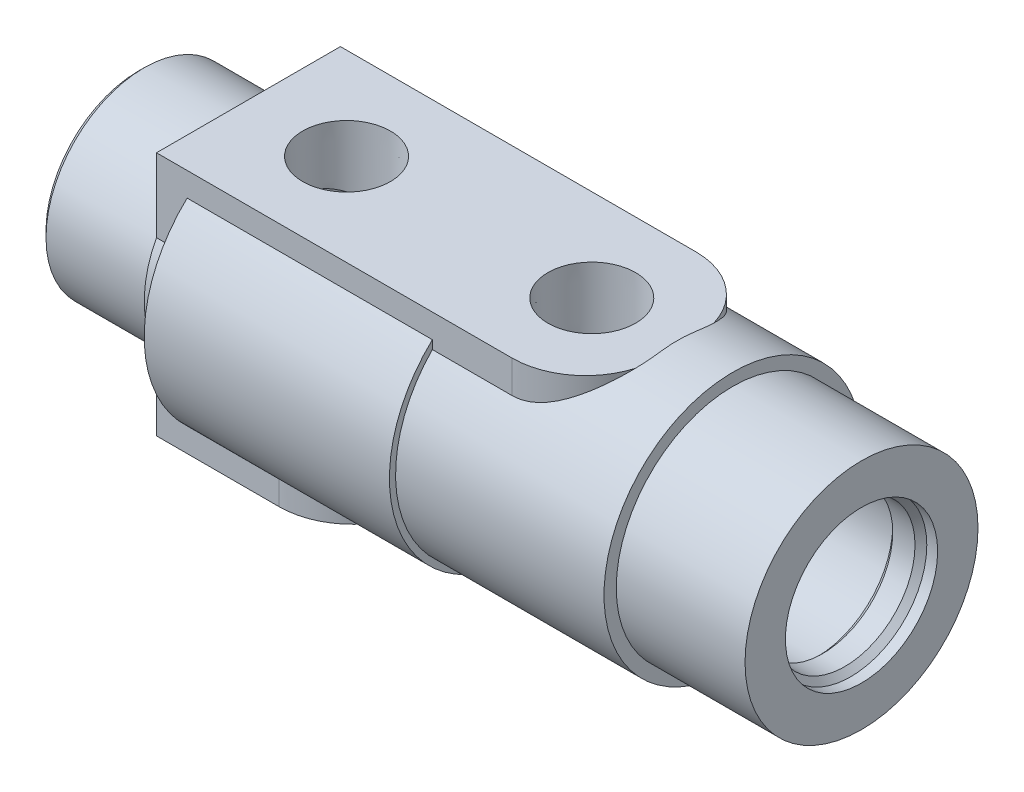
ISO-10303-21;
HEADER;
FILE_DESCRIPTION(('STEP AP214'),'2;1');
FILE_NAME('part.step','',(''),(''),'','','');
FILE_SCHEMA(('AUTOMOTIVE_DESIGN { 1 0 10303 214 1 1 1 1 }'));
ENDSEC;
DATA;
#1=APPLICATION_CONTEXT('core data for automotive mechanical design processes');
#2=APPLICATION_PROTOCOL_DEFINITION('international standard','automotive_design',2000,#1);
#3=PRODUCT_CONTEXT('',#1,'mechanical');
#4=PRODUCT('Part','Part','',(#3));
#5=PRODUCT_RELATED_PRODUCT_CATEGORY('part','',(#4));
#6=PRODUCT_DEFINITION_FORMATION('','',#4);
#7=PRODUCT_DEFINITION_CONTEXT('part definition',#1,'design');
#8=PRODUCT_DEFINITION('design','',#6,#7);
#9=PRODUCT_DEFINITION_SHAPE('','',#8);
#10=(LENGTH_UNIT() NAMED_UNIT(*) SI_UNIT(.MILLI.,.METRE.));
#11=(NAMED_UNIT(*) PLANE_ANGLE_UNIT() SI_UNIT($,.RADIAN.));
#12=(NAMED_UNIT(*) SI_UNIT($,.STERADIAN.) SOLID_ANGLE_UNIT());
#13=UNCERTAINTY_MEASURE_WITH_UNIT(LENGTH_MEASURE(1.E-05),#10,'distance_accuracy_value','');
#14=(GEOMETRIC_REPRESENTATION_CONTEXT(3) GLOBAL_UNCERTAINTY_ASSIGNED_CONTEXT((#13)) GLOBAL_UNIT_ASSIGNED_CONTEXT((#10,
#11,#12)) REPRESENTATION_CONTEXT('',''));
#15=CARTESIAN_POINT('',(0.,0.,0.));
#16=DIRECTION('',(0.,0.,1.));
#17=DIRECTION('',(1.,0.,0.));
#18=AXIS2_PLACEMENT_3D('',#15,#16,#17);
#19=CARTESIAN_POINT('',(-57.15,8.92810000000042,0.));
#20=DIRECTION('',(1.,0.,0.));
#21=DIRECTION('',(0.,0.,-1.));
#22=AXIS2_PLACEMENT_3D('',#19,#20,#21);
#23=PLANE('',#22);
#24=CARTESIAN_POINT('',(-57.15,4.13652044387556E-13,0.));
#25=DIRECTION('',(-1.,0.,0.));
#26=DIRECTION('',(0.,0.,1.));
#27=AXIS2_PLACEMENT_3D('',#24,#25,#26);
#28=CIRCLE('',#27,8.92810000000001);
#29=CARTESIAN_POINT('',(-57.15,4.13652044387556E-13,8.92810000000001));
#30=VERTEX_POINT('',#29);
#31=EDGE_CURVE('E401',#30,#30,#28,.T.);
#32=ORIENTED_EDGE('',*,*,#31,.T.);
#33=EDGE_LOOP('',(#32));
#34=FACE_BOUND('',#33,.T.);
#35=CARTESIAN_POINT('',(-57.15,0.,0.));
#36=DIRECTION('',(-1.,0.,0.));
#37=DIRECTION('',(0.,0.,1.));
#38=AXIS2_PLACEMENT_3D('',#35,#36,#37);
#39=CIRCLE('',#38,8.5727286);
#40=CARTESIAN_POINT('',(-57.15,0.,8.57272860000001));
#41=VERTEX_POINT('',#40);
#42=EDGE_CURVE('E404',#41,#41,#39,.T.);
#43=ORIENTED_EDGE('',*,*,#42,.F.);
#44=EDGE_LOOP('',(#43));
#45=FACE_BOUND('',#44,.T.);
#46=ADVANCED_FACE('F32',(#34,#45),#23,.F.);
#47=CARTESIAN_POINT('',(-61.156596,7.2644,5.518404));
#48=DIRECTION('',(0.,-1.,0.));
#49=DIRECTION('',(0.,0.,-1.));
#50=AXIS2_PLACEMENT_3D('',#47,#48,#49);
#51=PLANE('',#50);
#52=CARTESIAN_POINT('',(-66.675,7.26439999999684,0.));
#53=DIRECTION('',(0.,1.,0.));
#54=DIRECTION('',(0.,0.,1.));
#55=AXIS2_PLACEMENT_3D('',#52,#53,#54);
#56=CIRCLE('',#55,5.4102);
#57=CARTESIAN_POINT('',(-68.201696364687,7.26439999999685,5.19032390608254));
#58=VERTEX_POINT('',#57);
#59=CARTESIAN_POINT('',(-65.148303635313,7.26439999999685,5.19032390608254));
#60=VERTEX_POINT('',#59);
#61=EDGE_CURVE('E432',#58,#60,#56,.T.);
#62=ORIENTED_EDGE('',*,*,#61,.T.);
#63=DIRECTION('',(-1.,0.,0.));
#64=VECTOR('',#63,1.);
#65=CARTESIAN_POINT('',(-93.6498000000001,7.2644,5.19032390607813));
#66=LINE('',#65,#64);
#67=CARTESIAN_POINT('',(-65.3394453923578,7.2644,5.19032390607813));
#68=VERTEX_POINT('',#67);
#69=EDGE_CURVE('E647',#60,#68,#66,.T.);
#70=ORIENTED_EDGE('',*,*,#69,.T.);
#71=CARTESIAN_POINT('',(-66.675,7.2644,0.));
#72=DIRECTION('',(0.,-1.,0.));
#73=DIRECTION('',(0.,0.,-1.));
#74=AXIS2_PLACEMENT_3D('',#71,#72,#73);
#75=CIRCLE('',#74,5.3594);
#76=CARTESIAN_POINT('',(-68.0105546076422,7.2644,5.19032390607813));
#77=VERTEX_POINT('',#76);
#78=EDGE_CURVE('E436',#77,#68,#75,.F.);
#79=ORIENTED_EDGE('',*,*,#78,.F.);
#80=EDGE_CURVE('E645',#77,#58,#66,.T.);
#81=ORIENTED_EDGE('',*,*,#80,.T.);
#82=EDGE_LOOP('',(#62,#70,#79,#81));
#83=FACE_BOUND('',#82,.T.);
#84=ADVANCED_FACE('F373',(#83),#51,.F.);
#85=CARTESIAN_POINT('',(-72.193404,-7.2644,5.518404));
#86=DIRECTION('',(0.,1.,0.));
#87=DIRECTION('',(0.,0.,1.));
#88=AXIS2_PLACEMENT_3D('',#85,#86,#87);
#89=PLANE('',#88);
#90=CARTESIAN_POINT('',(-66.675,-7.26439999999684,0.));
#91=DIRECTION('',(0.,-1.,0.));
#92=DIRECTION('',(0.,0.,-1.));
#93=AXIS2_PLACEMENT_3D('',#90,#91,#92);
#94=CIRCLE('',#93,5.41020000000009);
#95=CARTESIAN_POINT('',(-68.2016963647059,-7.26439999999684,-5.19032390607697));
#96=VERTEX_POINT('',#95);
#97=CARTESIAN_POINT('',(-65.1483036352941,-7.26439999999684,-5.19032390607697));
#98=VERTEX_POINT('',#97);
#99=EDGE_CURVE('E236',#96,#98,#94,.T.);
#100=ORIENTED_EDGE('',*,*,#99,.T.);
#101=DIRECTION('',(-1.,0.,0.));
#102=VECTOR('',#101,1.);
#103=CARTESIAN_POINT('',(-93.6498000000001,-7.2644,-5.19032390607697));
#104=LINE('',#103,#102);
#105=CARTESIAN_POINT('',(-65.3394453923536,-7.2644,-5.19032390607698));
#106=VERTEX_POINT('',#105);
#107=EDGE_CURVE('E223',#98,#106,#104,.T.);
#108=ORIENTED_EDGE('',*,*,#107,.T.);
#109=CARTESIAN_POINT('',(-66.675,-7.2644,0.));
#110=DIRECTION('',(0.,-1.,0.));
#111=DIRECTION('',(0.,0.,-1.));
#112=AXIS2_PLACEMENT_3D('',#109,#110,#111);
#113=CIRCLE('',#112,5.3594);
#114=CARTESIAN_POINT('',(-68.0105546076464,-7.2644,-5.19032390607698));
#115=VERTEX_POINT('',#114);
#116=EDGE_CURVE('E234',#115,#106,#113,.T.);
#117=ORIENTED_EDGE('',*,*,#116,.F.);
#118=EDGE_CURVE('E61',#115,#96,#104,.T.);
#119=ORIENTED_EDGE('',*,*,#118,.T.);
#120=EDGE_LOOP('',(#100,#108,#117,#119));
#121=FACE_BOUND('',#120,.T.);
#122=ADVANCED_FACE('F233',(#121),#89,.F.);
#123=CARTESIAN_POINT('',(-93.6498,12.7,0.));
#124=DIRECTION('',(1.,0.,0.));
#125=DIRECTION('',(0.,1.,0.));
#126=AXIS2_PLACEMENT_3D('',#123,#124,#125);
#127=PLANE('',#126);
#128=CARTESIAN_POINT('',(-93.6498,0.,0.));
#129=DIRECTION('',(1.,0.,0.));
#130=DIRECTION('',(0.,1.,0.));
#131=AXIS2_PLACEMENT_3D('',#128,#129,#130);
#132=CIRCLE('',#131,11.938);
#133=CARTESIAN_POINT('',(-93.6498,11.9380000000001,0.));
#134=VERTEX_POINT('',#133);
#135=EDGE_CURVE('E251',#134,#134,#132,.F.);
#136=ORIENTED_EDGE('',*,*,#135,.T.);
#137=EDGE_LOOP('',(#136));
#138=FACE_BOUND('',#137,.T.);
#139=CARTESIAN_POINT('',(-93.6498000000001,4.13652044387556E-13,0.));
#140=DIRECTION('',(-1.,0.,0.));
#141=DIRECTION('',(0.,0.,1.));
#142=AXIS2_PLACEMENT_3D('',#139,#140,#141);
#143=CIRCLE('',#142,10.6677714);
#144=CARTESIAN_POINT('',(-93.6498000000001,4.13652044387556E-13,10.6677714));
#145=VERTEX_POINT('',#144);
#146=EDGE_CURVE('E417',#145,#145,#143,.T.);
#147=ORIENTED_EDGE('',*,*,#146,.F.);
#148=EDGE_LOOP('',(#147));
#149=FACE_BOUND('',#148,.T.);
#150=ADVANCED_FACE('F469',(#138,#149),#127,.F.);
#151=CARTESIAN_POINT('',(-66.675,7.2644,0.));
#152=DIRECTION('',(0.,-1.,0.));
#153=DIRECTION('',(0.,0.,-1.));
#154=AXIS2_PLACEMENT_3D('',#151,#152,#153);
#155=CYLINDRICAL_SURFACE('',#154,5.3594);
#156=ORIENTED_EDGE('',*,*,#78,.T.);
#157=CARTESIAN_POINT('',(-65.3394453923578,7.2644,5.19032390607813));
#158=CARTESIAN_POINT('',(-65.4596322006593,7.24227184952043,5.22126857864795));
#159=CARTESIAN_POINT('',(-65.5813911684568,7.22279873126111,5.24812925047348));
#160=CARTESIAN_POINT('',(-65.8273087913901,7.18969067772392,5.29340894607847));
#161=CARTESIAN_POINT('',(-65.9514686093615,7.17605864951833,5.31182376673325));
#162=CARTESIAN_POINT('',(-66.1980855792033,7.15545437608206,5.33954298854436));
#163=CARTESIAN_POINT('',(-66.3205035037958,7.14831873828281,5.34907106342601));
#164=CARTESIAN_POINT('',(-66.5658358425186,7.14035461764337,5.35969600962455));
#165=CARTESIAN_POINT('',(-66.6887500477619,7.13952371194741,5.36079611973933));
#166=CARTESIAN_POINT('',(-67.0126539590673,7.14573827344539,5.35252455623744));
#167=CARTESIAN_POINT('',(-67.2134497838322,7.15814419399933,5.33602792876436));
#168=CARTESIAN_POINT('',(-67.5130730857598,7.18887354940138,5.29446221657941));
#169=CARTESIAN_POINT('',(-67.6137700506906,7.20134090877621,5.27752413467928));
#170=CARTESIAN_POINT('',(-67.8134921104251,7.23009086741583,5.23806692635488));
#171=CARTESIAN_POINT('',(-67.9125175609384,7.24637264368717,5.2155490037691));
#172=CARTESIAN_POINT('',(-68.0105546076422,7.2644,5.19032390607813));
#173=B_SPLINE_CURVE_WITH_KNOTS('',3,(#157,#158,#159,#160,#161,#162,#163,#164,#165,#166,#167,
#168,#169,#170,#171,#172),.UNSPECIFIED.,.F.,.F.,(4,2,2,2,2,2,2,4),(0.,0.378133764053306,
0.756455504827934,1.12497561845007,1.49335410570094,2.09663902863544,2.40505484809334,
2.71340418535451),.UNSPECIFIED.);
#174=EDGE_CURVE('E11',#68,#77,#173,.T.);
#175=ORIENTED_EDGE('',*,*,#174,.T.);
#176=EDGE_LOOP('',(#156,#175));
#177=FACE_BOUND('',#176,.T.);
#178=ADVANCED_FACE('F388',(#177),#155,.F.);
#179=CARTESIAN_POINT('',(-65.3394453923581,7.2644,-5.19032390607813));
#180=VERTEX_POINT('',#179);
#181=CARTESIAN_POINT('',(-68.0105546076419,7.2644,-5.19032390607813));
#182=VERTEX_POINT('',#181);
#183=EDGE_CURVE('E244',#180,#182,#75,.F.);
#184=ORIENTED_EDGE('',*,*,#183,.T.);
#185=CARTESIAN_POINT('',(-68.0105546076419,7.2644,-5.19032390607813));
#186=CARTESIAN_POINT('',(-67.8903677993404,7.24227184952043,-5.22126857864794));
#187=CARTESIAN_POINT('',(-67.7686088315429,7.22279873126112,-5.24812925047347));
#188=CARTESIAN_POINT('',(-67.5226912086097,7.18969067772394,-5.29340894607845));
#189=CARTESIAN_POINT('',(-67.3985313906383,7.17605864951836,-5.31182376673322));
#190=CARTESIAN_POINT('',(-67.1519144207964,7.1554543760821,-5.33954298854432));
#191=CARTESIAN_POINT('',(-67.0294964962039,7.14831873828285,-5.34907106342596));
#192=CARTESIAN_POINT('',(-66.7841641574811,7.14035461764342,-5.35969600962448));
#193=CARTESIAN_POINT('',(-66.6612499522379,7.13952371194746,-5.36079611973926));
#194=CARTESIAN_POINT('',(-66.3373460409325,7.14573827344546,-5.35252455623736));
#195=CARTESIAN_POINT('',(-66.1365502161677,7.15814419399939,-5.33602792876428));
#196=CARTESIAN_POINT('',(-65.8369269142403,7.18887354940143,-5.29446221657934));
#197=CARTESIAN_POINT('',(-65.7362299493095,7.20134090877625,-5.27752413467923));
#198=CARTESIAN_POINT('',(-65.5365078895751,7.23009086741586,-5.23806692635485));
#199=CARTESIAN_POINT('',(-65.4374824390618,7.24637264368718,-5.21554900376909));
#200=CARTESIAN_POINT('',(-65.3394453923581,7.2644,-5.19032390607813));
#201=B_SPLINE_CURVE_WITH_KNOTS('',3,(#185,#186,#187,#188,#189,#190,#191,#192,#193,#194,#195,
#196,#197,#198,#199,#200),.UNSPECIFIED.,.F.,.F.,(4,2,2,2,2,2,2,4),(0.,0.378133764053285,
0.756455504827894,1.12497561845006,1.49335410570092,2.09663902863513,2.40505484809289,
2.71340418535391),.UNSPECIFIED.);
#202=EDGE_CURVE('E46',#182,#180,#201,.T.);
#203=ORIENTED_EDGE('',*,*,#202,.T.);
#204=EDGE_LOOP('',(#184,#203));
#205=FACE_BOUND('',#204,.T.);
#206=ADVANCED_FACE('F444',(#205),#155,.F.);
#207=CARTESIAN_POINT('',(-65.3394453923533,-7.2644,5.19032390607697));
#208=VERTEX_POINT('',#207);
#209=CARTESIAN_POINT('',(-68.0105546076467,-7.2644,5.19032390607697));
#210=VERTEX_POINT('',#209);
#211=EDGE_CURVE('E240',#208,#210,#113,.T.);
#212=ORIENTED_EDGE('',*,*,#211,.T.);
#213=CARTESIAN_POINT('',(-68.0105546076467,-7.2644,5.19032390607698));
#214=CARTESIAN_POINT('',(-67.8903677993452,-7.24227184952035,5.22126857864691));
#215=CARTESIAN_POINT('',(-67.7686088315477,-7.22279873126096,5.24812925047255));
#216=CARTESIAN_POINT('',(-67.5226912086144,-7.18969067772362,5.29340894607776));
#217=CARTESIAN_POINT('',(-67.398531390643,-7.17605864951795,5.31182376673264));
#218=CARTESIAN_POINT('',(-67.1519144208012,-7.15545437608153,5.33954298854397));
#219=CARTESIAN_POINT('',(-67.0294964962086,-7.1483187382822,5.34907106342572));
#220=CARTESIAN_POINT('',(-66.7841641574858,-7.14035461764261,5.35969600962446));
#221=CARTESIAN_POINT('',(-66.6612499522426,-7.13952371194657,5.36079611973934));
#222=CARTESIAN_POINT('',(-66.3373460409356,-7.14573827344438,5.35252455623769));
#223=CARTESIAN_POINT('',(-66.1365502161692,-7.15814419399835,5.33602792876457));
#224=CARTESIAN_POINT('',(-65.8369269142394,-7.18887354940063,5.2944622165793));
#225=CARTESIAN_POINT('',(-65.7362299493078,-7.20134090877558,5.27752413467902));
#226=CARTESIAN_POINT('',(-65.5365078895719,-7.23009086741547,5.23806692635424));
#227=CARTESIAN_POINT('',(-65.4374824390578,-7.24637264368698,5.21554900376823));
#228=CARTESIAN_POINT('',(-65.3394453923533,-7.2644,5.19032390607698));
#229=B_SPLINE_CURVE_WITH_KNOTS('',3,(#213,#214,#215,#216,#217,#218,#219,#220,#221,#222,#223,
#224,#225,#226,#227,#228),.UNSPECIFIED.,.F.,.F.,(4,2,2,2,2,2,2,4),(0.,0.378133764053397,
0.756455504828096,1.12497561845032,1.49335410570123,2.09663902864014,2.40505484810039,
2.71340418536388),.UNSPECIFIED.);
#230=EDGE_CURVE('E228',#210,#208,#229,.T.);
#231=ORIENTED_EDGE('',*,*,#230,.T.);
#232=EDGE_LOOP('',(#212,#231));
#233=FACE_BOUND('',#232,.T.);
#234=ADVANCED_FACE('F389',(#233),#155,.F.);
#235=CARTESIAN_POINT('',(-39.6875,0.,0.));
#236=DIRECTION('',(1.,0.,0.));
#237=DIRECTION('',(0.,0.,-1.));
#238=AXIS2_PLACEMENT_3D('',#235,#236,#237);
#239=CYLINDRICAL_SURFACE('',#238,13.49375);
#240=CARTESIAN_POINT('',(-75.409764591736,0.,0.));
#241=DIRECTION('',(1.,0.,0.));
#242=DIRECTION('',(0.,0.,-1.));
#243=AXIS2_PLACEMENT_3D('',#240,#241,#242);
#244=CIRCLE('',#243,13.49375);
#245=CARTESIAN_POINT('',(-75.409764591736,-6.34999999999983,-11.90625));
#246=VERTEX_POINT('',#245);
#247=CARTESIAN_POINT('',(-75.409764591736,6.35,-11.90625));
#248=VERTEX_POINT('',#247);
#249=EDGE_CURVE('E603',#246,#248,#244,.T.);
#250=ORIENTED_EDGE('',*,*,#249,.F.);
#251=DIRECTION('',(1.,0.,0.));
#252=VECTOR('',#251,1.);
#253=CARTESIAN_POINT('',(-39.6875,-6.34999999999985,-11.90625));
#254=LINE('',#253,#252);
#255=CARTESIAN_POINT('',(-79.375,-6.34999999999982,-11.90625));
#256=VERTEX_POINT('',#255);
#257=EDGE_CURVE('E690',#246,#256,#254,.F.);
#258=ORIENTED_EDGE('',*,*,#257,.T.);
#259=CARTESIAN_POINT('',(-79.375,0.,0.));
#260=DIRECTION('',(1.,0.,0.));
#261=DIRECTION('',(0.,0.,-1.));
#262=AXIS2_PLACEMENT_3D('',#259,#260,#261);
#263=CIRCLE('',#262,13.49375);
#264=CARTESIAN_POINT('',(-79.375,6.35,-11.90625));
#265=VERTEX_POINT('',#264);
#266=EDGE_CURVE('E644',#256,#265,#263,.T.);
#267=ORIENTED_EDGE('',*,*,#266,.T.);
#268=DIRECTION('',(1.,0.,0.));
#269=VECTOR('',#268,1.);
#270=CARTESIAN_POINT('',(-39.6875,6.35,-11.90625));
#271=LINE('',#270,#269);
#272=EDGE_CURVE('E745',#265,#248,#271,.T.);
#273=ORIENTED_EDGE('',*,*,#272,.T.);
#274=EDGE_LOOP('',(#250,#258,#267,#273));
#275=FACE_BOUND('',#274,.T.);
#276=ADVANCED_FACE('F457',(#275),#239,.T.);
#277=CARTESIAN_POINT('',(-18.5427656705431,0.,-7.91801276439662));
#278=DIRECTION('',(1.,0.,0.));
#279=DIRECTION('',(0.,0.,-1.));
#280=AXIS2_PLACEMENT_3D('',#277,#278,#279);
#281=PLANE('',#280);
#282=CARTESIAN_POINT('',(-18.5427656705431,0.,0.));
#283=DIRECTION('',(1.,0.,0.));
#284=DIRECTION('',(0.,0.,-1.));
#285=AXIS2_PLACEMENT_3D('',#282,#283,#284);
#286=CIRCLE('',#285,7.1374);
#287=CARTESIAN_POINT('',(-18.5427656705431,0.,-7.13739999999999));
#288=VERTEX_POINT('',#287);
#289=EDGE_CURVE('E414',#288,#288,#286,.T.);
#290=ORIENTED_EDGE('',*,*,#289,.F.);
#291=EDGE_LOOP('',(#290));
#292=FACE_BOUND('',#291,.T.);
#293=CARTESIAN_POINT('',(-18.5427665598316,0.,0.));
#294=DIRECTION('',(1.,0.,0.));
#295=DIRECTION('',(0.,0.,-1.));
#296=AXIS2_PLACEMENT_3D('',#293,#294,#295);
#297=CIRCLE('',#296,9.09232641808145);
#298=CARTESIAN_POINT('',(-18.5427665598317,0.,-9.09232641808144));
#299=VERTEX_POINT('',#298);
#300=EDGE_CURVE('E257',#299,#299,#297,.T.);
#301=ORIENTED_EDGE('',*,*,#300,.T.);
#302=EDGE_LOOP('',(#301));
#303=FACE_BOUND('',#302,.T.);
#304=ADVANCED_FACE('F462',(#292,#303),#281,.T.);
#305=CARTESIAN_POINT('',(-17.7798920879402,0.,0.));
#306=DIRECTION('',(1.,0.,0.));
#307=DIRECTION('',(0.,0.,-1.));
#308=AXIS2_PLACEMENT_3D('',#305,#306,#307);
#309=CONICAL_SURFACE('',#308,9.85520088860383,0.785398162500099);
#310=CARTESIAN_POINT('',(-17.7798911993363,0.,0.));
#311=DIRECTION('',(1.,0.,0.));
#312=DIRECTION('',(0.,0.,-1.));
#313=AXIS2_PLACEMENT_3D('',#310,#311,#312);
#314=CIRCLE('',#313,9.8552);
#315=CARTESIAN_POINT('',(-17.7798911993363,0.,-9.85519999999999));
#316=VERTEX_POINT('',#315);
#317=EDGE_CURVE('E246',#316,#316,#314,.T.);
#318=ORIENTED_EDGE('',*,*,#317,.T.);
#319=EDGE_LOOP('',(#318));
#320=FACE_BOUND('',#319,.T.);
#321=ORIENTED_EDGE('',*,*,#300,.F.);
#322=EDGE_LOOP('',(#321));
#323=FACE_BOUND('',#322,.T.);
#324=ADVANCED_FACE('F867',(#320,#323),#309,.F.);
#325=CARTESIAN_POINT('',(-11.7958906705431,0.,0.));
#326=DIRECTION('',(1.,0.,0.));
#327=DIRECTION('',(0.,0.,-1.));
#328=AXIS2_PLACEMENT_3D('',#325,#326,#327);
#329=CYLINDRICAL_SURFACE('',#328,9.8552);
#330=CARTESIAN_POINT('',(-5.81188925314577,0.,0.));
#331=DIRECTION('',(-1.,0.,0.));
#332=DIRECTION('',(0.,-1.,0.));
#333=AXIS2_PLACEMENT_3D('',#330,#331,#332);
#334=CIRCLE('',#333,9.85520088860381);
#335=CARTESIAN_POINT('',(-5.81188925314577,-9.85520088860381,0.));
#336=VERTEX_POINT('',#335);
#337=EDGE_CURVE('E241',#336,#336,#334,.F.);
#338=ORIENTED_EDGE('',*,*,#337,.T.);
#339=EDGE_LOOP('',(#338));
#340=FACE_BOUND('',#339,.T.);
#341=ORIENTED_EDGE('',*,*,#317,.F.);
#342=EDGE_LOOP('',(#341));
#343=FACE_BOUND('',#342,.T.);
#344=ADVANCED_FACE('F387',(#340,#343),#329,.F.);
#345=ORIENTED_EDGE('',*,*,#116,.T.);
#346=CARTESIAN_POINT('',(-65.3394453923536,-7.2644,-5.19032390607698));
#347=CARTESIAN_POINT('',(-65.4596322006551,-7.24227184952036,-5.2212685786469));
#348=CARTESIAN_POINT('',(-65.5813911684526,-7.22279873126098,-5.24812925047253));
#349=CARTESIAN_POINT('',(-65.8273087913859,-7.18969067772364,-5.29340894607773));
#350=CARTESIAN_POINT('',(-65.9514686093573,-7.17605864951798,-5.3118237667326));
#351=CARTESIAN_POINT('',(-66.1980855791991,-7.15545437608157,-5.33954298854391));
#352=CARTESIAN_POINT('',(-66.3205035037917,-7.14831873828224,-5.34907106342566));
#353=CARTESIAN_POINT('',(-66.5658358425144,-7.14035461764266,-5.35969600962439));
#354=CARTESIAN_POINT('',(-66.6887500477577,-7.13952371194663,-5.36079611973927));
#355=CARTESIAN_POINT('',(-67.0126539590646,-7.14573827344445,-5.35252455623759));
#356=CARTESIAN_POINT('',(-67.2134497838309,-7.15814419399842,-5.33602792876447));
#357=CARTESIAN_POINT('',(-67.5130730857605,-7.18887354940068,-5.29446221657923));
#358=CARTESIAN_POINT('',(-67.6137700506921,-7.20134090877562,-5.27752413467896));
#359=CARTESIAN_POINT('',(-67.8134921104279,-7.2300908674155,-5.2380669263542));
#360=CARTESIAN_POINT('',(-67.9125175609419,-7.24637264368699,-5.21554900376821));
#361=CARTESIAN_POINT('',(-68.0105546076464,-7.2644,-5.19032390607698));
#362=B_SPLINE_CURVE_WITH_KNOTS('',3,(#346,#347,#348,#349,#350,#351,#352,#353,#354,#355,#356,
#357,#358,#359,#360,#361),.UNSPECIFIED.,.F.,.F.,(4,2,2,2,2,2,2,4),(0.,0.378133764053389,
0.756455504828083,1.12497561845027,1.49335410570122,2.09663902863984,2.40505484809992,
2.71340418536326),.UNSPECIFIED.);
#363=EDGE_CURVE('E220',#106,#115,#362,.T.);
#364=ORIENTED_EDGE('',*,*,#363,.T.);
#365=EDGE_LOOP('',(#345,#364));
#366=FACE_BOUND('',#365,.T.);
#367=ADVANCED_FACE('F239',(#366),#155,.F.);
#368=CARTESIAN_POINT('',(-34.925,7.2644,0.));
#369=DIRECTION('',(0.,-1.,0.));
#370=DIRECTION('',(0.,0.,-1.));
#371=AXIS2_PLACEMENT_3D('',#368,#369,#370);
#372=CYLINDRICAL_SURFACE('',#371,5.3594);
#373=CARTESIAN_POINT('',(-34.925,4.71373635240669,-5.35939999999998));
#374=CARTESIAN_POINT('',(-34.799941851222,4.71372360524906,-5.35940634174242));
#375=CARTESIAN_POINT('',(-34.6749279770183,4.71873467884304,-5.35501487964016));
#376=CARTESIAN_POINT('',(-34.4262263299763,4.73843252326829,-5.33759488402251));
#377=CARTESIAN_POINT('',(-34.3025390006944,4.75312243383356,-5.32456354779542));
#378=CARTESIAN_POINT('',(-34.057463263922,4.79136994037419,-5.29017056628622));
#379=CARTESIAN_POINT('',(-33.9360805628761,4.81494712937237,-5.26879051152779));
#380=CARTESIAN_POINT('',(-33.6966943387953,4.86974846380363,-5.21818170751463));
#381=CARTESIAN_POINT('',(-33.5786929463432,4.90097731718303,-5.18894812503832));
#382=CARTESIAN_POINT('',(-33.2340829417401,5.00308263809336,-5.0912079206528));
#383=CARTESIAN_POINT('',(-33.013109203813,5.08304165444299,-5.01210600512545));
#384=CARTESIAN_POINT('',(-32.5884318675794,5.2574924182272,-4.82879182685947));
#385=CARTESIAN_POINT('',(-32.384726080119,5.35198231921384,-4.72458275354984));
#386=CARTESIAN_POINT('',(-32.0716556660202,5.50913269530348,-4.53876575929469));
#387=CARTESIAN_POINT('',(-31.9567837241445,5.56963957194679,-4.4644664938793));
#388=CARTESIAN_POINT('',(-31.7334440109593,5.69180065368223,-4.30764152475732));
#389=CARTESIAN_POINT('',(-31.6249773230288,5.75345505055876,-4.22511443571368));
#390=CARTESIAN_POINT('',(-31.309086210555,5.93842206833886,-3.96519275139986));
#391=CARTESIAN_POINT('',(-31.1113563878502,6.06164148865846,-3.77556823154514));
#392=CARTESIAN_POINT('',(-30.8177072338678,6.25157344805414,-3.44685310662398));
#393=CARTESIAN_POINT('',(-30.7125315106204,6.32129994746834,-3.31758412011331));
#394=CARTESIAN_POINT('',(-30.5135193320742,6.45562224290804,-3.0479617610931));
#395=CARTESIAN_POINT('',(-30.4196854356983,6.52021687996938,-2.90760589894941));
#396=CARTESIAN_POINT('',(-30.2447300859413,6.64231341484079,-2.61667788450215));
#397=CARTESIAN_POINT('',(-30.163584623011,6.69982866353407,-2.46612581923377));
#398=CARTESIAN_POINT('',(-30.0151310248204,6.80613233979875,-2.15544669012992));
#399=CARTESIAN_POINT('',(-29.9478155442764,6.85492539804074,-1.99532476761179));
#400=CARTESIAN_POINT('',(-29.8464526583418,6.92893567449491,-1.71650908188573));
#401=CARTESIAN_POINT('',(-29.8085001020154,6.95682078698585,-1.59992544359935));
#402=CARTESIAN_POINT('',(-29.7404414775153,7.00702704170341,-1.36332764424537));
#403=CARTESIAN_POINT('',(-29.7103336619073,7.029349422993,-1.2433142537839));
#404=CARTESIAN_POINT('',(-29.6583815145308,7.06797561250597,-1.00064249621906));
#405=CARTESIAN_POINT('',(-29.6365315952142,7.08428349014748,-0.87798597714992));
#406=CARTESIAN_POINT('',(-29.6013844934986,7.11055946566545,-0.630771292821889));
#407=CARTESIAN_POINT('',(-29.5880876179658,7.12052733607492,-0.506213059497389));
#408=CARTESIAN_POINT('',(-29.5702337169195,7.13391878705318,-0.255811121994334));
#409=CARTESIAN_POINT('',(-29.5656981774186,7.1373262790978,-0.12996501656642));
#410=CARTESIAN_POINT('',(-29.565504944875,7.13747137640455,0.121783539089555));
#411=CARTESIAN_POINT('',(-29.5698504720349,7.13420656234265,0.247685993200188));
#412=CARTESIAN_POINT('',(-29.5873541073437,7.12107721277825,0.498504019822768));
#413=CARTESIAN_POINT('',(-29.6005106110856,7.11121387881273,0.623419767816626));
#414=CARTESIAN_POINT('',(-29.6354344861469,7.08510265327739,0.871408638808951));
#415=CARTESIAN_POINT('',(-29.6572051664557,7.06885230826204,0.99448103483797));
#416=CARTESIAN_POINT('',(-29.7081314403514,7.03098484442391,1.2336406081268));
#417=CARTESIAN_POINT('',(-29.7370022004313,7.00957524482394,1.34982156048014));
#418=CARTESIAN_POINT('',(-29.8021008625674,6.96153198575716,1.57901401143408));
#419=CARTESIAN_POINT('',(-29.8383313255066,6.9348965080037,1.69202439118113));
#420=CARTESIAN_POINT('',(-29.9574461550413,6.84784149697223,2.0253808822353));
#421=CARTESIAN_POINT('',(-30.0507915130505,6.78024502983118,2.24022515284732));
#422=CARTESIAN_POINT('',(-30.2732554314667,6.62202930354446,2.67399339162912));
#423=CARTESIAN_POINT('',(-30.4051513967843,6.52971058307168,2.89084474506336));
#424=CARTESIAN_POINT('',(-30.6948962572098,6.33259510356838,3.30035929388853));
#425=CARTESIAN_POINT('',(-30.8527671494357,6.22778778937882,3.4930017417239));
#426=CARTESIAN_POINT('',(-31.1233566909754,6.05522435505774,3.78054970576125));
#427=CARTESIAN_POINT('',(-31.228792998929,5.98946532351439,3.88366882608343));
#428=CARTESIAN_POINT('',(-31.4474646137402,5.8570456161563,4.08063237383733));
#429=CARTESIAN_POINT('',(-31.5606985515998,5.79038510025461,4.1744784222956));
#430=CARTESIAN_POINT('',(-31.7947872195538,5.65758225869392,4.35276957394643));
#431=CARTESIAN_POINT('',(-31.9156474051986,5.59144034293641,4.43720782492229));
#432=CARTESIAN_POINT('',(-32.1647342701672,5.46142069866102,4.59629525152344));
#433=CARTESIAN_POINT('',(-32.2929593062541,5.39754247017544,4.67094659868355));
#434=CARTESIAN_POINT('',(-32.6368941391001,5.23636366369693,4.85234430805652));
#435=CARTESIAN_POINT('',(-32.8584832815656,5.14229833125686,4.95108471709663));
#436=CARTESIAN_POINT('',(-33.3197428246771,4.97497223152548,5.11920579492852));
#437=CARTESIAN_POINT('',(-33.5593709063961,4.90166458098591,5.18865280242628));
#438=CARTESIAN_POINT('',(-34.0042078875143,4.79898507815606,5.2835733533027));
#439=CARTESIAN_POINT('',(-34.2067377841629,4.7637636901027,5.31505781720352));
#440=CARTESIAN_POINT('',(-34.6168047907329,4.71942437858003,5.35448101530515));
#441=CARTESIAN_POINT('',(-34.8243350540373,4.71027260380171,5.3624502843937));
#442=CARTESIAN_POINT('',(-35.2383536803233,4.71959897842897,5.3542393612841));
#443=CARTESIAN_POINT('',(-35.4448415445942,4.73808928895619,5.33804853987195));
#444=CARTESIAN_POINT('',(-35.8510735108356,4.79962066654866,5.28278022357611));
#445=CARTESIAN_POINT('',(-36.0508054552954,4.84270373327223,5.24366357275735));
#446=CARTESIAN_POINT('',(-36.5124665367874,4.96719475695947,5.12631459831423));
#447=CARTESIAN_POINT('',(-36.7698194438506,5.05690288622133,5.03893584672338));
#448=CARTESIAN_POINT('',(-37.1386025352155,5.20640609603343,4.88273149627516));
#449=CARTESIAN_POINT('',(-37.2587987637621,5.2588074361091,4.82638562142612));
#450=CARTESIAN_POINT('',(-37.4934830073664,5.36708585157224,4.7056816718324));
#451=CARTESIAN_POINT('',(-37.6079715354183,5.42296261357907,4.64132431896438));
#452=CARTESIAN_POINT('',(-37.9507169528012,5.59772659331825,4.43189304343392));
#453=CARTESIAN_POINT('',(-38.1696022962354,5.72005058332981,4.27414632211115));
#454=CARTESIAN_POINT('',(-38.5818269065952,5.9635690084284,3.92725284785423));
#455=CARTESIAN_POINT('',(-38.7751535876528,6.08476285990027,3.73809072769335));
#456=CARTESIAN_POINT('',(-39.0637202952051,6.27227769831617,3.40906004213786));
#457=CARTESIAN_POINT('',(-39.1678669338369,6.34160904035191,3.27863058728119));
#458=CARTESIAN_POINT('',(-39.3646970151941,6.47494893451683,3.00672992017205));
#459=CARTESIAN_POINT('',(-39.4573778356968,6.53895626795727,2.86525619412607));
#460=CARTESIAN_POINT('',(-39.6299174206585,6.65971280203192,2.57211907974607));
#461=CARTESIAN_POINT('',(-39.7097977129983,6.71647415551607,2.42047342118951));
#462=CARTESIAN_POINT('',(-39.8555650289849,6.82108525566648,2.10770505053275));
#463=CARTESIAN_POINT('',(-39.9214596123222,6.86893981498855,1.94658751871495));
#464=CARTESIAN_POINT('',(-40.0201300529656,6.94110260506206,1.66662832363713));
#465=CARTESIAN_POINT('',(-40.0568783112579,6.96814161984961,1.54987229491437));
#466=CARTESIAN_POINT('',(-40.122515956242,7.01662250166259,1.31304361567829));
#467=CARTESIAN_POINT('',(-40.1514070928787,7.03806561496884,1.19297171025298));
#468=CARTESIAN_POINT('',(-40.200926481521,7.07491607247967,0.950311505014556));
#469=CARTESIAN_POINT('',(-40.221560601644,7.09032770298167,0.827725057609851));
#470=CARTESIAN_POINT('',(-40.2542939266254,7.1148131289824,0.580780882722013));
#471=CARTESIAN_POINT('',(-40.2663928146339,7.12388668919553,0.45642308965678));
#472=CARTESIAN_POINT('',(-40.2818827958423,7.13550820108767,0.206579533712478));
#473=CARTESIAN_POINT('',(-40.2852543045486,7.13804147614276,0.0810918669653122));
#474=CARTESIAN_POINT('',(-40.283178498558,7.1364828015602,-0.169814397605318));
#475=CARTESIAN_POINT('',(-40.2777279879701,7.13238845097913,-0.295232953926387));
#476=CARTESIAN_POINT('',(-40.2580909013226,7.11766302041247,-0.544974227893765));
#477=CARTESIAN_POINT('',(-40.2439056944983,7.10703296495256,-0.66929711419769));
#478=CARTESIAN_POINT('',(-40.2070135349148,7.07946519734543,-0.916005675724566));
#479=CARTESIAN_POINT('',(-40.1843032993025,7.06252505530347,-1.03839058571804));
#480=CARTESIAN_POINT('',(-40.1315124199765,7.023302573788,-1.27664491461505));
#481=CARTESIAN_POINT('',(-40.101679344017,7.00120012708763,-1.3925990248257));
#482=CARTESIAN_POINT('',(-40.0346875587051,6.95181337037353,-1.62125720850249));
#483=CARTESIAN_POINT('',(-39.9975262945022,6.92452725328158,-1.73396013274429));
#484=CARTESIAN_POINT('',(-39.8756761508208,6.83559728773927,-2.06629054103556));
#485=CARTESIAN_POINT('',(-39.7805819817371,6.76685244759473,-2.28031194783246));
#486=CARTESIAN_POINT('',(-39.5541544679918,6.60615743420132,-2.71299847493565));
#487=CARTESIAN_POINT('',(-39.4199509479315,6.51246837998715,-2.92948665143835));
#488=CARTESIAN_POINT('',(-39.1255537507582,6.31285982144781,-3.33795872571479));
#489=CARTESIAN_POINT('',(-38.9653366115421,6.2069293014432,-3.52992022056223));
#490=CARTESIAN_POINT('',(-38.6908603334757,6.03280433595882,-3.81622344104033));
#491=CARTESIAN_POINT('',(-38.5838986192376,5.96649058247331,-3.91886798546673));
#492=CARTESIAN_POINT('',(-38.3621266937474,5.833120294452,-4.11475499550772));
#493=CARTESIAN_POINT('',(-38.2473179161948,5.76606389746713,-4.20799917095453));
#494=CARTESIAN_POINT('',(-38.0100220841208,5.63267495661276,-4.38494372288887));
#495=CARTESIAN_POINT('',(-37.8875299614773,5.56634292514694,-4.46863769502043));
#496=CARTESIAN_POINT('',(-37.6351078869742,5.43620504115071,-4.62607798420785));
#497=CARTESIAN_POINT('',(-37.5051798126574,5.37239855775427,-4.69982679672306));
#498=CARTESIAN_POINT('',(-37.1608690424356,5.21376141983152,-4.87649177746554));
#499=CARTESIAN_POINT('',(-36.9409218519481,5.12221359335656,-4.97176220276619));
#500=CARTESIAN_POINT('',(-36.4835927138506,4.96016677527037,-5.13346023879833));
#501=CARTESIAN_POINT('',(-36.2462583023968,4.88961287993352,-5.1999632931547));
#502=CARTESIAN_POINT('',(-35.8274904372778,4.79633913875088,-5.28586928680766));
#503=CARTESIAN_POINT('',(-35.6494829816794,4.76570971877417,-5.31330325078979));
#504=CARTESIAN_POINT('',(-35.2892836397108,4.72442484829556,-5.35005742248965));
#505=CARTESIAN_POINT('',(-35.1070948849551,4.71375491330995,-5.3593907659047));
#506=CARTESIAN_POINT('',(-34.925,4.71373635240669,-5.35939999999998));
#507=B_SPLINE_CURVE_WITH_KNOTS('',3,(#373,#374,#375,#376,#377,#378,#379,#380,#381,#382,#383,
#384,#385,#386,#387,#388,#389,#390,#391,#392,#393,#394,#395,#396,#397,#398,#399,#400,#401,#402,
#403,#404,#405,#406,#407,#408,#409,#410,#411,#412,#413,#414,#415,#416,#417,#418,#419,#420,#421,
#422,#423,#424,#425,#426,#427,#428,#429,#430,#431,#432,#433,#434,#435,#436,#437,#438,#439,#440,
#441,#442,#443,#444,#445,#446,#447,#448,#449,#450,#451,#452,#453,#454,#455,#456,#457,#458,#459,
#460,#461,#462,#463,#464,#465,#466,#467,#468,#469,#470,#471,#472,#473,#474,#475,#476,#477,#478,
#479,#480,#481,#482,#483,#484,#485,#486,#487,#488,#489,#490,#491,#492,#493,#494,#495,#496,#497,
#498,#499,#500,#501,#502,#503,#504,#505,#506),.UNSPECIFIED.,.T.,.F.,(4,2,2,2,2,2,2,2,2,2,2,2,2,
2,2,2,2,2,2,2,2,2,2,2,2,2,2,2,2,2,2,2,2,2,2,2,2,2,2,2,2,2,2,2,2,2,2,2,2,2,2,2,2,2,2,2,2,2,2,2,2,
2,2,2,2,2,4),(0.,0.37492559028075,0.749972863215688,1.12585185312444,1.50196269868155,
2.24276461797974,2.98347248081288,3.43188754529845,3.88037823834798,4.77806436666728,
5.31939556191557,5.86084866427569,6.40126447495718,6.94139251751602,7.31822942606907,
7.69498232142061,8.07147983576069,8.44799085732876,8.82542405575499,9.20299413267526,
9.58049547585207,9.95814197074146,10.3225838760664,10.6871528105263,11.415759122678,
12.2231800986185,13.0312883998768,13.5153195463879,13.9992659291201,14.4835625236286,
14.9677514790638,15.7456975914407,16.5218723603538,17.1430941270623,17.7635088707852,
18.3841966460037,19.0059476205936,19.8595205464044,20.2874049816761,20.7152508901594,
21.6009759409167,22.4871355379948,23.0286686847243,23.5703254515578,24.1110614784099,
24.6515044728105,25.0271913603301,25.4027945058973,25.7781302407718,26.1534799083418,
26.529671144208,26.9059986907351,27.2822672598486,27.658680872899,28.0235432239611,
28.3885330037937,29.1179810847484,29.929335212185,30.741425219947,31.2282265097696,
31.714939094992,32.2019761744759,32.6888908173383,33.4560766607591,34.2212381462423,
34.7675570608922,35.3134793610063),.UNSPECIFIED.);
#508=CARTESIAN_POINT('',(-34.925,4.71373635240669,-5.35939999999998));
#509=VERTEX_POINT('',#508);
#510=EDGE_CURVE('E36',#509,#509,#507,.T.);
#511=ORIENTED_EDGE('',*,*,#510,.T.);
#512=EDGE_LOOP('',(#511));
#513=FACE_BOUND('',#512,.T.);
#514=CARTESIAN_POINT('',(-34.925,7.2644,0.));
#515=DIRECTION('',(0.,-1.,0.));
#516=DIRECTION('',(0.,0.,-1.));
#517=AXIS2_PLACEMENT_3D('',#514,#515,#516);
#518=CIRCLE('',#517,5.3594);
#519=CARTESIAN_POINT('',(-34.925,7.2644,-5.35939999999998));
#520=VERTEX_POINT('',#519);
#521=EDGE_CURVE('E266',#520,#520,#518,.F.);
#522=ORIENTED_EDGE('',*,*,#521,.T.);
#523=EDGE_LOOP('',(#522));
#524=FACE_BOUND('',#523,.T.);
#525=ADVANCED_FACE('F377',(#513,#524),#372,.F.);
#526=CARTESIAN_POINT('',(-5.81188925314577,0.,0.));
#527=DIRECTION('',(-1.,0.,0.));
#528=DIRECTION('',(0.,0.,1.));
#529=AXIS2_PLACEMENT_3D('',#526,#527,#528);
#530=CONICAL_SURFACE('',#529,9.85520088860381,0.785398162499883);
#531=CARTESIAN_POINT('',(-5.04901567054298,0.,0.));
#532=DIRECTION('',(1.,0.,0.));
#533=DIRECTION('',(0.,0.,-1.));
#534=AXIS2_PLACEMENT_3D('',#531,#532,#533);
#535=CIRCLE('',#534,9.09232552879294);
#536=CARTESIAN_POINT('',(-5.04901567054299,0.,-9.09232552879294));
#537=VERTEX_POINT('',#536);
#538=EDGE_CURVE('E263',#537,#537,#535,.T.);
#539=ORIENTED_EDGE('',*,*,#538,.T.);
#540=EDGE_LOOP('',(#539));
#541=FACE_BOUND('',#540,.T.);
#542=ORIENTED_EDGE('',*,*,#337,.F.);
#543=EDGE_LOOP('',(#542));
#544=FACE_BOUND('',#543,.T.);
#545=ADVANCED_FACE('F375',(#541,#544),#530,.F.);
#546=CARTESIAN_POINT('',(-65.1483036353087,-7.26439999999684,5.19032390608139));
#547=VERTEX_POINT('',#546);
#548=CARTESIAN_POINT('',(-68.2016963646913,-7.26439999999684,5.19032390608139));
#549=VERTEX_POINT('',#548);
#550=EDGE_CURVE('E430',#547,#549,#94,.T.);
#551=ORIENTED_EDGE('',*,*,#550,.T.);
#552=DIRECTION('',(-1.,0.,0.));
#553=VECTOR('',#552,1.);
#554=CARTESIAN_POINT('',(-93.6498000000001,-7.2644,5.19032390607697));
#555=LINE('',#554,#553);
#556=EDGE_CURVE('E449',#549,#210,#555,.F.);
#557=ORIENTED_EDGE('',*,*,#556,.T.);
#558=ORIENTED_EDGE('',*,*,#211,.F.);
#559=EDGE_CURVE('E451',#208,#547,#555,.F.);
#560=ORIENTED_EDGE('',*,*,#559,.T.);
#561=EDGE_LOOP('',(#551,#557,#558,#560));
#562=FACE_BOUND('',#561,.T.);
#563=ADVANCED_FACE('F371',(#562),#89,.F.);
#564=CARTESIAN_POINT('',(-65.1483036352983,7.26439999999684,-5.19032390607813));
#565=VERTEX_POINT('',#564);
#566=CARTESIAN_POINT('',(-68.2016963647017,7.26439999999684,-5.19032390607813));
#567=VERTEX_POINT('',#566);
#568=EDGE_CURVE('E448',#565,#567,#56,.T.);
#569=ORIENTED_EDGE('',*,*,#568,.T.);
#570=DIRECTION('',(-1.,0.,0.));
#571=VECTOR('',#570,1.);
#572=CARTESIAN_POINT('',(-93.6498000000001,7.2644,-5.19032390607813));
#573=LINE('',#572,#571);
#574=EDGE_CURVE('E343',#567,#182,#573,.F.);
#575=ORIENTED_EDGE('',*,*,#574,.T.);
#576=ORIENTED_EDGE('',*,*,#183,.F.);
#577=EDGE_CURVE('E53',#180,#565,#573,.F.);
#578=ORIENTED_EDGE('',*,*,#577,.T.);
#579=EDGE_LOOP('',(#569,#575,#576,#578));
#580=FACE_BOUND('',#579,.T.);
#581=ADVANCED_FACE('F367',(#580),#51,.F.);
#582=CARTESIAN_POINT('',(-29.406596,7.2644,5.518404));
#583=DIRECTION('',(0.,-1.,0.));
#584=DIRECTION('',(0.,0.,-1.));
#585=AXIS2_PLACEMENT_3D('',#582,#583,#584);
#586=PLANE('',#585);
#587=CARTESIAN_POINT('',(-34.925,7.26439999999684,0.));
#588=DIRECTION('',(0.,1.,0.));
#589=DIRECTION('',(0.,0.,1.));
#590=AXIS2_PLACEMENT_3D('',#587,#588,#589);
#591=CIRCLE('',#590,5.4102);
#592=CARTESIAN_POINT('',(-34.925,7.26439999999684,5.41020000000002));
#593=VERTEX_POINT('',#592);
#594=EDGE_CURVE('E271',#593,#593,#591,.T.);
#595=ORIENTED_EDGE('',*,*,#594,.T.);
#596=EDGE_LOOP('',(#595));
#597=FACE_BOUND('',#596,.T.);
#598=ORIENTED_EDGE('',*,*,#521,.F.);
#599=EDGE_LOOP('',(#598));
#600=FACE_BOUND('',#599,.T.);
#601=ADVANCED_FACE('F363',(#597,#600),#586,.F.);
#602=CARTESIAN_POINT('',(-3.60720366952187,0.,0.));
#603=DIRECTION('',(1.,0.,0.));
#604=DIRECTION('',(0.,0.,-1.));
#605=AXIS2_PLACEMENT_3D('',#602,#603,#604);
#606=CYLINDRICAL_SURFACE('',#605,9.09232552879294);
#607=CARTESIAN_POINT('',(-2.16539255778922,0.,0.));
#608=DIRECTION('',(1.,0.,0.));
#609=DIRECTION('',(0.,1.,0.));
#610=AXIS2_PLACEMENT_3D('',#607,#608,#609);
#611=CIRCLE('',#610,9.09232641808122);
#612=CARTESIAN_POINT('',(-2.16539255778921,9.09232641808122,0.));
#613=VERTEX_POINT('',#612);
#614=EDGE_CURVE('E267',#613,#613,#611,.T.);
#615=ORIENTED_EDGE('',*,*,#614,.T.);
#616=EDGE_LOOP('',(#615));
#617=FACE_BOUND('',#616,.T.);
#618=ORIENTED_EDGE('',*,*,#538,.F.);
#619=EDGE_LOOP('',(#618));
#620=FACE_BOUND('',#619,.T.);
#621=ADVANCED_FACE('F361',(#617,#620),#606,.F.);
#622=CARTESIAN_POINT('',(-66.675,-15.8750000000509,0.));
#623=DIRECTION('',(0.,-1.,0.));
#624=DIRECTION('',(0.,0.,-1.));
#625=AXIS2_PLACEMENT_3D('',#622,#623,#624);
#626=CONICAL_SURFACE('',#625,5.67927965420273,0.0312396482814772);
#627=ORIENTED_EDGE('',*,*,#550,.F.);
#628=CARTESIAN_POINT('',(-65.1492777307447,-7.26419999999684,5.19060381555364));
#629=CARTESIAN_POINT('',(-64.998376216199,-7.29516324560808,5.14724744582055));
#630=CARTESIAN_POINT('',(-64.8502316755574,-7.32998309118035,5.09772060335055));
#631=CARTESIAN_POINT('',(-64.5601936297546,-7.40579167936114,4.98696185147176));
#632=CARTESIAN_POINT('',(-64.4182937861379,-7.44677397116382,4.92574216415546));
#633=CARTESIAN_POINT('',(-64.0034867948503,-7.5764870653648,4.72576694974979));
#634=CARTESIAN_POINT('',(-63.7405025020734,-7.67220086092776,4.57041108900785));
#635=CARTESIAN_POINT('',(-63.3701624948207,-7.82058489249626,4.30807655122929));
#636=CARTESIAN_POINT('',(-63.2508837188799,-7.87077730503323,4.21589269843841));
#637=CARTESIAN_POINT('',(-63.020470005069,-7.97157273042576,4.02205751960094));
#638=CARTESIAN_POINT('',(-62.909334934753,-8.02217573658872,3.9204063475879));
#639=CARTESIAN_POINT('',(-62.5886101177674,-8.17285526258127,3.60146086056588));
#640=CARTESIAN_POINT('',(-62.3918192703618,-8.2717527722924,3.37025849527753));
#641=CARTESIAN_POINT('',(-62.1211209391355,-8.41322952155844,2.99137581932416));
#642=CARTESIAN_POINT('',(-62.0328679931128,-8.46046812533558,2.85538030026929));
#643=CARTESIAN_POINT('',(-61.8683897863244,-8.55003549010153,2.57478040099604));
#644=CARTESIAN_POINT('',(-61.7921586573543,-8.59236664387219,2.43018026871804));
#645=CARTESIAN_POINT('',(-61.6527254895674,-8.67082117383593,2.13339561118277));
#646=CARTESIAN_POINT('',(-61.5895108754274,-8.70695053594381,1.98121858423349));
#647=CARTESIAN_POINT('',(-61.4769615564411,-8.77190036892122,1.6703084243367));
#648=CARTESIAN_POINT('',(-61.4276241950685,-8.80072223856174,1.51157655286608));
#649=CARTESIAN_POINT('',(-61.3487040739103,-8.84712513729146,1.20830187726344));
#650=CARTESIAN_POINT('',(-61.3174648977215,-8.86563802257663,1.06433107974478));
#651=CARTESIAN_POINT('',(-61.2668799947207,-8.89572065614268,0.773606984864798));
#652=CARTESIAN_POINT('',(-61.247532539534,-8.90729141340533,0.626854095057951));
#653=CARTESIAN_POINT('',(-61.2210509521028,-8.92314881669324,0.331936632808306));
#654=CARTESIAN_POINT('',(-61.2139103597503,-8.92743931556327,0.183772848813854));
#655=CARTESIAN_POINT('',(-61.2119448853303,-8.92861908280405,-0.11266085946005));
#656=CARTESIAN_POINT('',(-61.2171190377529,-8.92550893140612,-0.260930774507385));
#657=CARTESIAN_POINT('',(-61.2383673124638,-8.91277693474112,-0.538901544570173));
#658=CARTESIAN_POINT('',(-61.2530951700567,-8.9039596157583,-0.668745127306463));
#659=CARTESIAN_POINT('',(-61.2918918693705,-8.88083279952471,-0.926572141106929));
#660=CARTESIAN_POINT('',(-61.315963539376,-8.86652163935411,-1.05455499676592));
#661=CARTESIAN_POINT('',(-61.3731471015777,-8.8327293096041,-1.30773082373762));
#662=CARTESIAN_POINT('',(-61.4062552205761,-8.81325029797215,-1.43292493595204));
#663=CARTESIAN_POINT('',(-61.4811416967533,-8.76953826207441,-1.67985917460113));
#664=CARTESIAN_POINT('',(-61.5229234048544,-8.7453034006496,-1.80159794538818));
#665=CARTESIAN_POINT('',(-61.6629352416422,-8.66487379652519,-2.1665166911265));
#666=CARTESIAN_POINT('',(-61.7744325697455,-8.60180338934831,-2.40325344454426));
#667=CARTESIAN_POINT('',(-62.0282898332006,-8.46255504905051,-2.85522065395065));
#668=CARTESIAN_POINT('',(-62.170672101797,-8.38636763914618,-3.07043538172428));
#669=CARTESIAN_POINT('',(-62.5034186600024,-8.21566940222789,-3.50353234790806));
#670=CARTESIAN_POINT('',(-62.697632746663,-8.12006687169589,-3.71803214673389));
#671=CARTESIAN_POINT('',(-63.1169457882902,-7.92724510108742,-4.11316551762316));
#672=CARTESIAN_POINT('',(-63.3420363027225,-7.83002630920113,-4.29380831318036));
#673=CARTESIAN_POINT('',(-63.8173372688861,-7.64403406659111,-4.61671012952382));
#674=CARTESIAN_POINT('',(-64.0672210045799,-7.55517470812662,-4.75939575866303));
#675=CARTESIAN_POINT('',(-64.5911224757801,-7.39439832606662,-5.00554892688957));
#676=CARTESIAN_POINT('',(-64.8651853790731,-7.32251397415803,-5.10894106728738));
#677=CARTESIAN_POINT('',(-65.149277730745,-7.26419999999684,-5.19060381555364));
#678=B_SPLINE_CURVE_WITH_KNOTS('',3,(#628,#629,#630,#631,#632,#633,#634,#635,#636,#637,#638,
#639,#640,#641,#642,#643,#644,#645,#646,#647,#648,#649,#650,#651,#652,#653,#654,#655,#656,#657,
#658,#659,#660,#661,#662,#663,#664,#665,#666,#667,#668,#669,#670,#671,#672,#673,#674,#675,#676,
#677),.UNSPECIFIED.,.F.,.F.,(4,2,2,2,2,2,2,2,2,2,2,2,2,2,2,2,2,2,2,2,2,2,2,2,4),(0.,
0.479589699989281,0.958680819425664,1.91380440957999,2.39007904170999,2.86634592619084,
3.81933514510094,4.32536433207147,4.83114574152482,5.33643619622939,5.84162985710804,
6.28643438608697,6.73117425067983,7.17567867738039,7.62014825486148,8.01260978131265,
8.40519019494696,8.79760693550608,9.19017556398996,9.99417791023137,10.7987635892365,
11.7093262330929,12.619640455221,13.5192441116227,14.4205653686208),.UNSPECIFIED.);
#679=EDGE_CURVE('E327',#547,#98,#678,.T.);
#680=ORIENTED_EDGE('',*,*,#679,.T.);
#681=ORIENTED_EDGE('',*,*,#99,.F.);
#682=CARTESIAN_POINT('',(-68.2007222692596,-7.2641999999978,-5.19060381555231));
#683=CARTESIAN_POINT('',(-68.3516237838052,-7.29516324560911,-5.14724744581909));
#684=CARTESIAN_POINT('',(-68.4997683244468,-7.32998309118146,-5.09772060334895));
#685=CARTESIAN_POINT('',(-68.7898063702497,-7.40579167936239,-4.98696185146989));
#686=CARTESIAN_POINT('',(-68.9317062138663,-7.44677397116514,-4.92574216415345));
#687=CARTESIAN_POINT('',(-69.3465132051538,-7.57648706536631,-4.72576694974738));
#688=CARTESIAN_POINT('',(-69.6094974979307,-7.67220086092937,-4.57041108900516));
#689=CARTESIAN_POINT('',(-69.9798375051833,-7.82058489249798,-4.30807655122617));
#690=CARTESIAN_POINT('',(-70.099116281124,-7.87077730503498,-4.21589269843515));
#691=CARTESIAN_POINT('',(-70.3295299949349,-7.97157273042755,-4.02205751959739));
#692=CARTESIAN_POINT('',(-70.4406650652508,-8.02217573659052,-3.92040634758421));
#693=CARTESIAN_POINT('',(-70.7613898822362,-8.1728552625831,-3.60146086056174));
#694=CARTESIAN_POINT('',(-70.9581807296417,-8.27175277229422,-3.3702584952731));
#695=CARTESIAN_POINT('',(-71.2288790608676,-8.41322952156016,-2.99137581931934));
#696=CARTESIAN_POINT('',(-71.3171320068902,-8.46046812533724,-2.85538030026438));
#697=CARTESIAN_POINT('',(-71.4816102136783,-8.55003549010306,-2.57478040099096));
#698=CARTESIAN_POINT('',(-71.5578413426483,-8.59236664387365,-2.43018026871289));
#699=CARTESIAN_POINT('',(-71.6972745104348,-8.67082117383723,-2.13339561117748));
#700=CARTESIAN_POINT('',(-71.7604891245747,-8.70695053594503,-1.98121858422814));
#701=CARTESIAN_POINT('',(-71.8730384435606,-8.77190036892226,-1.67030842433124));
#702=CARTESIAN_POINT('',(-71.9223758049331,-8.80072223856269,-1.51157655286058));
#703=CARTESIAN_POINT('',(-72.001295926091,-8.84712513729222,-1.20830187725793));
#704=CARTESIAN_POINT('',(-72.0325351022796,-8.86563802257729,-1.0643310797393));
#705=CARTESIAN_POINT('',(-72.08312000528,-8.89572065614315,-0.773606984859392));
#706=CARTESIAN_POINT('',(-72.1024674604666,-8.9072914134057,-0.626854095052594));
#707=CARTESIAN_POINT('',(-72.1289490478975,-8.92314881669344,-0.331936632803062));
#708=CARTESIAN_POINT('',(-72.1360896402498,-8.92743931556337,-0.183772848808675));
#709=CARTESIAN_POINT('',(-72.1380551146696,-8.92861908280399,0.112660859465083));
#710=CARTESIAN_POINT('',(-72.1328809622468,-8.92550893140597,0.260930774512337));
#711=CARTESIAN_POINT('',(-72.1116326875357,-8.91277693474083,0.538901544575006));
#712=CARTESIAN_POINT('',(-72.0969048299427,-8.90395961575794,0.668745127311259));
#713=CARTESIAN_POINT('',(-72.0581081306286,-8.88083279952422,0.926572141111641));
#714=CARTESIAN_POINT('',(-72.0340364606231,-8.86652163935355,1.05455499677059));
#715=CARTESIAN_POINT('',(-71.9768528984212,-8.83272930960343,1.30773082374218));
#716=CARTESIAN_POINT('',(-71.9437447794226,-8.81325029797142,1.43292493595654));
#717=CARTESIAN_POINT('',(-71.8688583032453,-8.76953826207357,1.6798591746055));
#718=CARTESIAN_POINT('',(-71.8270765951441,-8.74530340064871,1.80159794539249));
#719=CARTESIAN_POINT('',(-71.687064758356,-8.66487379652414,2.16651669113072));
#720=CARTESIAN_POINT('',(-71.5755674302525,-8.60180338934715,2.40325344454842));
#721=CARTESIAN_POINT('',(-71.3217101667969,-8.46255504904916,2.85522065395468));
#722=CARTESIAN_POINT('',(-71.1793278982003,-8.38636763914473,3.07043538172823));
#723=CARTESIAN_POINT('',(-70.8465813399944,-8.21566940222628,3.50353234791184));
#724=CARTESIAN_POINT('',(-70.6523672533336,-8.1200668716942,3.71803214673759));
#725=CARTESIAN_POINT('',(-70.2330542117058,-7.92724510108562,4.11316551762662));
#726=CARTESIAN_POINT('',(-70.0079636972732,-7.8300263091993,4.29380831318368));
#727=CARTESIAN_POINT('',(-69.5326627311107,-7.64403406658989,4.61671012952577));
#728=CARTESIAN_POINT('',(-69.2827789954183,-7.555174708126,4.75939575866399));
#729=CARTESIAN_POINT('',(-68.7588775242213,-7.39439832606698,5.00554892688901));
#730=CARTESIAN_POINT('',(-68.48481462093,-7.32251397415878,5.10894106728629));
#731=CARTESIAN_POINT('',(-68.20072226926,-7.2641999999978,5.19060381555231));
#732=B_SPLINE_CURVE_WITH_KNOTS('',3,(#682,#683,#684,#685,#686,#687,#688,#689,#690,#691,#692,
#693,#694,#695,#696,#697,#698,#699,#700,#701,#702,#703,#704,#705,#706,#707,#708,#709,#710,#711,
#712,#713,#714,#715,#716,#717,#718,#719,#720,#721,#722,#723,#724,#725,#726,#727,#728,#729,#730,
#731),.UNSPECIFIED.,.F.,.F.,(4,2,2,2,2,2,2,2,2,2,2,2,2,2,2,2,2,2,2,2,2,2,2,2,4),(0.,
0.479589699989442,0.958680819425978,1.91380440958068,2.39007904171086,2.86634592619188,
3.81933514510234,4.32536433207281,4.83114574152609,5.33643619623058,5.84162985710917,
6.28643438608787,6.73117425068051,7.17567867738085,7.62014825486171,8.01260978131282,
8.40519019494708,8.79760693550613,9.19017556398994,9.99417791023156,10.7987635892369,
11.7093262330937,12.6196404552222,13.5192441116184,14.420565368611),.UNSPECIFIED.);
#733=EDGE_CURVE('E237',#96,#549,#732,.T.);
#734=ORIENTED_EDGE('',*,*,#733,.T.);
#735=EDGE_LOOP('',(#627,#680,#681,#734));
#736=FACE_BOUND('',#735,.T.);
#737=CARTESIAN_POINT('',(-66.675,-15.8749999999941,0.));
#738=DIRECTION('',(0.,-1.,0.));
#739=DIRECTION('',(0.,0.,-1.));
#740=AXIS2_PLACEMENT_3D('',#737,#738,#739);
#741=CIRCLE('',#740,5.67927965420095);
#742=CARTESIAN_POINT('',(-66.675,-15.8749999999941,-5.67927965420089));
#743=VERTEX_POINT('',#742);
#744=EDGE_CURVE('E270',#743,#743,#741,.T.);
#745=ORIENTED_EDGE('',*,*,#744,.T.);
#746=EDGE_LOOP('',(#745));
#747=FACE_BOUND('',#746,.T.);
#748=ADVANCED_FACE('F354',(#736,#747),#626,.F.);
#749=CARTESIAN_POINT('',(-66.675,15.8749999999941,0.));
#750=DIRECTION('',(0.,1.,0.));
#751=DIRECTION('',(0.,0.,1.));
#752=AXIS2_PLACEMENT_3D('',#749,#750,#751);
#753=CONICAL_SURFACE('',#752,5.67927965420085,0.0312396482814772);
#754=ORIENTED_EDGE('',*,*,#568,.F.);
#755=CARTESIAN_POINT('',(-65.1492777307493,7.26419999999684,-5.1906038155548));
#756=CARTESIAN_POINT('',(-64.9983762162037,7.29516324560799,-5.14724744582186));
#757=CARTESIAN_POINT('',(-64.850231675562,7.32998309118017,-5.09772060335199));
#758=CARTESIAN_POINT('',(-64.5601936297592,7.40579167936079,-4.98696185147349));
#759=CARTESIAN_POINT('',(-64.4182937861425,7.4467739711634,-4.92574216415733));
#760=CARTESIAN_POINT('',(-64.0034867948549,7.57648706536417,-4.72576694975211));
#761=CARTESIAN_POINT('',(-63.7405025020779,7.67220086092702,-4.57041108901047));
#762=CARTESIAN_POINT('',(-63.370162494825,7.82058489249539,-4.30807655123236));
#763=CARTESIAN_POINT('',(-63.2508837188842,7.87077730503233,-4.21589269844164));
#764=CARTESIAN_POINT('',(-63.0204700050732,7.9715727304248,-4.02205751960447));
#765=CARTESIAN_POINT('',(-62.9093349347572,8.02217573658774,-3.9204063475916));
#766=CARTESIAN_POINT('',(-62.5886101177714,8.17285526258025,-3.60146086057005));
#767=CARTESIAN_POINT('',(-62.3918192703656,8.27175277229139,-3.37025849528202));
#768=CARTESIAN_POINT('',(-62.121120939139,8.41322952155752,-2.99137581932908));
#769=CARTESIAN_POINT('',(-62.0328679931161,8.46046812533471,-2.85538030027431));
#770=CARTESIAN_POINT('',(-61.8683897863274,8.55003549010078,-2.57478040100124));
#771=CARTESIAN_POINT('',(-61.7921586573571,8.59236664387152,-2.43018026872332));
#772=CARTESIAN_POINT('',(-61.6527254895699,8.67082117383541,-2.13339561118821));
#773=CARTESIAN_POINT('',(-61.5895108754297,8.70695053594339,-1.981218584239));
#774=CARTESIAN_POINT('',(-61.4769615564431,8.77190036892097,-1.67030842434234));
#775=CARTESIAN_POINT('',(-61.4276241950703,8.80072223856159,-1.51157655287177));
#776=CARTESIAN_POINT('',(-61.3487040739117,8.84712513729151,-1.20830187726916));
#777=CARTESIAN_POINT('',(-61.3174648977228,8.86563802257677,-1.06433107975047));
#778=CARTESIAN_POINT('',(-61.2668799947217,8.89572065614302,-0.773606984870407));
#779=CARTESIAN_POINT('',(-61.2475325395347,8.90729141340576,-0.626854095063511));
#780=CARTESIAN_POINT('',(-61.2210509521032,8.92314881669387,-0.33193663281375));
#781=CARTESIAN_POINT('',(-61.2139103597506,8.92743931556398,-0.183772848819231));
#782=CARTESIAN_POINT('',(-61.2119448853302,8.92861908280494,0.112660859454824));
#783=CARTESIAN_POINT('',(-61.2171190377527,8.92550893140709,0.260930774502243));
#784=CARTESIAN_POINT('',(-61.2383673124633,8.91277693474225,0.538901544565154));
#785=CARTESIAN_POINT('',(-61.2530951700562,8.9039596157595,0.668745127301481));
#786=CARTESIAN_POINT('',(-61.2918918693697,8.88083279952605,0.926572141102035));
#787=CARTESIAN_POINT('',(-61.3159635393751,8.86652163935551,1.05455499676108));
#788=CARTESIAN_POINT('',(-61.3731471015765,8.83272930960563,1.30773082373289));
#789=CARTESIAN_POINT('',(-61.4062552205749,8.81325029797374,1.43292493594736));
#790=CARTESIAN_POINT('',(-61.4811416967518,8.76953826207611,1.67985917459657));
#791=CARTESIAN_POINT('',(-61.5229234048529,8.74530340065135,1.8015979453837));
#792=CARTESIAN_POINT('',(-61.6629352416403,8.66487379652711,2.16651669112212));
#793=CARTESIAN_POINT('',(-61.7744325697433,8.60180338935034,2.40325344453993));
#794=CARTESIAN_POINT('',(-62.028289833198,8.46255504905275,2.85522065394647));
#795=CARTESIAN_POINT('',(-62.1706721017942,8.3863676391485,3.07043538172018));
#796=CARTESIAN_POINT('',(-62.5034186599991,8.21566940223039,3.50353234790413));
#797=CARTESIAN_POINT('',(-62.6976327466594,8.12006687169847,3.71803214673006));
#798=CARTESIAN_POINT('',(-63.116945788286,7.92724510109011,4.11316551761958));
#799=CARTESIAN_POINT('',(-63.342036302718,7.83002630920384,4.29380831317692));
#800=CARTESIAN_POINT('',(-63.8173372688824,7.64403406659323,4.61671012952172));
#801=CARTESIAN_POINT('',(-64.0672210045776,7.55517470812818,4.7593957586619));
#802=CARTESIAN_POINT('',(-64.5911224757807,7.39439832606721,5.00554892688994));
#803=CARTESIAN_POINT('',(-64.8651853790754,7.32251397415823,5.10894106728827));
#804=CARTESIAN_POINT('',(-65.149277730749,7.26419999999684,5.1906038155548));
#805=B_SPLINE_CURVE_WITH_KNOTS('',3,(#755,#756,#757,#758,#759,#760,#761,#762,#763,#764,#765,
#766,#767,#768,#769,#770,#771,#772,#773,#774,#775,#776,#777,#778,#779,#780,#781,#782,#783,#784,
#785,#786,#787,#788,#789,#790,#791,#792,#793,#794,#795,#796,#797,#798,#799,#800,#801,#802,#803,
#804),.UNSPECIFIED.,.F.,.F.,(4,2,2,2,2,2,2,2,2,2,2,2,2,2,2,2,2,2,2,2,2,2,2,2,4),(0.,
0.479589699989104,0.958680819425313,1.91380440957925,2.39007904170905,2.86634592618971,
3.81933514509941,4.32536433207,4.8311457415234,5.33643619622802,5.84162985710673,
6.28643438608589,6.73117425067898,7.17567867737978,7.62014825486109,8.01260978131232,
8.4051901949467,8.79760693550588,9.19017556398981,9.99417791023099,10.7987635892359,
11.7093262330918,12.6196404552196,13.5192441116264,14.4205653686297),.UNSPECIFIED.);
#806=EDGE_CURVE('E342',#565,#60,#805,.T.);
#807=ORIENTED_EDGE('',*,*,#806,.T.);
#808=ORIENTED_EDGE('',*,*,#61,.F.);
#809=CARTESIAN_POINT('',(-68.2007222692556,7.2641999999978,5.19060381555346));
#810=CARTESIAN_POINT('',(-68.3516237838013,7.29516324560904,5.14724744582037));
#811=CARTESIAN_POINT('',(-68.4997683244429,7.32998309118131,5.09772060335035));
#812=CARTESIAN_POINT('',(-68.7898063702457,7.40579167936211,4.98696185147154));
#813=CARTESIAN_POINT('',(-68.9317062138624,7.44677397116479,4.92574216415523));
#814=CARTESIAN_POINT('',(-69.3465132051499,7.57648706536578,4.72576694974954));
#815=CARTESIAN_POINT('',(-69.6094974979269,7.67220086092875,4.57041108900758));
#816=CARTESIAN_POINT('',(-69.9798375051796,7.82058489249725,4.30807655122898));
#817=CARTESIAN_POINT('',(-70.0991162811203,7.87077730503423,4.2158926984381));
#818=CARTESIAN_POINT('',(-70.3295299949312,7.97157273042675,4.02205751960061));
#819=CARTESIAN_POINT('',(-70.4406650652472,8.0221757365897,3.92040634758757));
#820=CARTESIAN_POINT('',(-70.7613898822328,8.17285526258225,3.60146086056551));
#821=CARTESIAN_POINT('',(-70.9581807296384,8.27175277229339,3.37025849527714));
#822=CARTESIAN_POINT('',(-71.2288790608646,8.41322952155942,2.99137581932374));
#823=CARTESIAN_POINT('',(-71.3171320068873,8.46046812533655,2.85538030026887));
#824=CARTESIAN_POINT('',(-71.4816102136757,8.55003549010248,2.5747804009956));
#825=CARTESIAN_POINT('',(-71.5578413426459,8.59236664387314,2.4301802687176));
#826=CARTESIAN_POINT('',(-71.6972745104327,8.67082117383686,2.13339561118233));
#827=CARTESIAN_POINT('',(-71.7604891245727,8.70695053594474,1.98121858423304));
#828=CARTESIAN_POINT('',(-71.873038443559,8.77190036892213,1.67030842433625));
#829=CARTESIAN_POINT('',(-71.9223758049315,8.80072223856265,1.51157655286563));
#830=CARTESIAN_POINT('',(-72.0012959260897,8.84712513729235,1.208301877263));
#831=CARTESIAN_POINT('',(-72.0325351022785,8.86563802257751,1.06433107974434));
#832=CARTESIAN_POINT('',(-72.0831200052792,8.89572065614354,0.773606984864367));
#833=CARTESIAN_POINT('',(-72.102467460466,8.90729141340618,0.626854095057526));
#834=CARTESIAN_POINT('',(-72.1289490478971,8.92314881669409,0.331936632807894));
#835=CARTESIAN_POINT('',(-72.1360896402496,8.9274393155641,0.183772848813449));
#836=CARTESIAN_POINT('',(-72.1380551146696,8.92861908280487,-0.11266085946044));
#837=CARTESIAN_POINT('',(-72.132880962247,8.92550893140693,-0.260930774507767));
#838=CARTESIAN_POINT('',(-72.1116326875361,8.91277693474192,-0.538901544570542));
#839=CARTESIAN_POINT('',(-72.0969048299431,8.9039596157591,-0.668745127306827));
#840=CARTESIAN_POINT('',(-72.0581081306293,8.8808327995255,-0.926572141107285));
#841=CARTESIAN_POINT('',(-72.0340364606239,8.86652163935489,-1.05455499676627));
#842=CARTESIAN_POINT('',(-71.9768528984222,8.83272930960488,-1.30773082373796));
#843=CARTESIAN_POINT('',(-71.9437447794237,8.81325029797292,-1.43292493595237));
#844=CARTESIAN_POINT('',(-71.8688583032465,8.76953826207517,-1.67985917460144));
#845=CARTESIAN_POINT('',(-71.8270765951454,8.74530340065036,-1.80159794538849));
#846=CARTESIAN_POINT('',(-71.6870647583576,8.66487379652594,-2.16651669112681));
#847=CARTESIAN_POINT('',(-71.5755674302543,8.60180338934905,-2.40325344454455));
#848=CARTESIAN_POINT('',(-71.3217101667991,8.46255504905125,-2.85522065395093));
#849=CARTESIAN_POINT('',(-71.1793278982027,8.38636763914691,-3.07043538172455));
#850=CARTESIAN_POINT('',(-70.8465813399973,8.21566940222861,-3.50353234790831));
#851=CARTESIAN_POINT('',(-70.6523672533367,8.1200668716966,-3.71803214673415));
#852=CARTESIAN_POINT('',(-70.2330542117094,7.92724510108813,-4.11316551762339));
#853=CARTESIAN_POINT('',(-70.0079636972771,7.83002630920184,-4.29380831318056));
#854=CARTESIAN_POINT('',(-69.5326627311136,7.64403406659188,-4.6167101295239));
#855=CARTESIAN_POINT('',(-69.2827789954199,7.55517470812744,-4.75939575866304));
#856=CARTESIAN_POINT('',(-68.75887752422,7.39439832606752,-5.00554892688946));
#857=CARTESIAN_POINT('',(-68.4848146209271,7.32251397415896,-5.10894106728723));
#858=CARTESIAN_POINT('',(-68.2007222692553,7.2641999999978,-5.19060381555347));
#859=B_SPLINE_CURVE_WITH_KNOTS('',3,(#809,#810,#811,#812,#813,#814,#815,#816,#817,#818,#819,
#820,#821,#822,#823,#824,#825,#826,#827,#828,#829,#830,#831,#832,#833,#834,#835,#836,#837,#838,
#839,#840,#841,#842,#843,#844,#845,#846,#847,#848,#849,#850,#851,#852,#853,#854,#855,#856,#857,
#858),.UNSPECIFIED.,.F.,.F.,(4,2,2,2,2,2,2,2,2,2,2,2,2,2,2,2,2,2,2,2,2,2,2,2,4),(0.,
0.479589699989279,0.958680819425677,1.91380440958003,2.39007904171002,2.86634592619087,
3.81933514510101,4.32536433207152,4.83114574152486,5.33643619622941,5.84162985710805,
6.28643438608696,6.73117425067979,7.17567867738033,7.6201482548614,8.01260978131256,
8.40519019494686,8.79760693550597,9.19017556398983,9.99417791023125,10.7987635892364,
11.7093262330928,12.6196404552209,13.5192441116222,14.4205653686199),.UNSPECIFIED.);
#860=EDGE_CURVE('E334',#58,#567,#859,.T.);
#861=ORIENTED_EDGE('',*,*,#860,.T.);
#862=EDGE_LOOP('',(#754,#807,#808,#861));
#863=FACE_BOUND('',#862,.T.);
#864=CARTESIAN_POINT('',(-66.675,15.8749999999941,0.));
#865=DIRECTION('',(0.,1.,0.));
#866=DIRECTION('',(0.,0.,1.));
#867=AXIS2_PLACEMENT_3D('',#864,#865,#866);
#868=CIRCLE('',#867,5.67927965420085);
#869=CARTESIAN_POINT('',(-66.675,15.8749999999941,5.67927965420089));
#870=VERTEX_POINT('',#869);
#871=EDGE_CURVE('E659',#870,#870,#868,.T.);
#872=ORIENTED_EDGE('',*,*,#871,.T.);
#873=EDGE_LOOP('',(#872));
#874=FACE_BOUND('',#873,.T.);
#875=ADVANCED_FACE('F349',(#863,#874),#753,.F.);
#876=CARTESIAN_POINT('',(-34.925,15.8749999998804,0.));
#877=DIRECTION('',(0.,1.,0.));
#878=DIRECTION('',(0.,0.,1.));
#879=AXIS2_PLACEMENT_3D('',#876,#877,#878);
#880=CONICAL_SURFACE('',#879,5.67927965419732,0.0312396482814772);
#881=ORIENTED_EDGE('',*,*,#594,.F.);
#882=EDGE_LOOP('',(#881));
#883=FACE_BOUND('',#882,.T.);
#884=CARTESIAN_POINT('',(-34.925,15.8749999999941,0.));
#885=DIRECTION('',(0.,1.,0.));
#886=DIRECTION('',(0.,0.,1.));
#887=AXIS2_PLACEMENT_3D('',#884,#885,#886);
#888=CIRCLE('',#887,5.67927965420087);
#889=CARTESIAN_POINT('',(-34.925,15.8749999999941,5.67927965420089));
#890=VERTEX_POINT('',#889);
#891=EDGE_CURVE('E662',#890,#890,#888,.T.);
#892=ORIENTED_EDGE('',*,*,#891,.T.);
#893=EDGE_LOOP('',(#892));
#894=FACE_BOUND('',#893,.T.);
#895=ADVANCED_FACE('F353',(#883,#894),#880,.F.);
#896=CARTESIAN_POINT('',(-1.4025180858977,0.,0.));
#897=DIRECTION('',(1.,0.,0.));
#898=DIRECTION('',(0.,1.,0.));
#899=AXIS2_PLACEMENT_3D('',#896,#897,#898);
#900=CONICAL_SURFACE('',#899,9.85520088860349,0.785398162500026);
#901=ORIENTED_EDGE('',*,*,#614,.F.);
#902=EDGE_LOOP('',(#901));
#903=FACE_BOUND('',#902,.T.);
#904=CARTESIAN_POINT('',(-1.40251719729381,0.,0.));
#905=DIRECTION('',(1.,0.,0.));
#906=DIRECTION('',(0.,0.,-1.));
#907=AXIS2_PLACEMENT_3D('',#904,#905,#906);
#908=CIRCLE('',#907,9.8551999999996);
#909=CARTESIAN_POINT('',(-1.40251719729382,0.,-9.8551999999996));
#910=VERTEX_POINT('',#909);
#911=EDGE_CURVE('E272',#910,#910,#908,.T.);
#912=ORIENTED_EDGE('',*,*,#911,.T.);
#913=EDGE_LOOP('',(#912));
#914=FACE_BOUND('',#913,.T.);
#915=ADVANCED_FACE('F850',(#903,#914),#900,.F.);
#916=CARTESIAN_POINT('',(-39.6875,-15.875,0.));
#917=DIRECTION('',(0.,1.,0.));
#918=DIRECTION('',(0.,0.,1.));
#919=AXIS2_PLACEMENT_3D('',#916,#917,#918);
#920=PLANE('',#919);
#921=DIRECTION('',(-1.,0.,0.));
#922=VECTOR('',#921,1.);
#923=CARTESIAN_POINT('',(-79.375,-15.875,-11.90625));
#924=LINE('',#923,#922);
#925=CARTESIAN_POINT('',(-63.5,-15.875,-11.90625));
#926=VERTEX_POINT('',#925);
#927=CARTESIAN_POINT('',(-79.375,-15.875,-11.90625));
#928=VERTEX_POINT('',#927);
#929=EDGE_CURVE('E697',#926,#928,#924,.T.);
#930=ORIENTED_EDGE('',*,*,#929,.F.);
#931=CARTESIAN_POINT('',(-63.5,-15.875,-2.38124999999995));
#932=DIRECTION('',(0.,1.,0.));
#933=DIRECTION('',(-1.,0.,0.));
#934=AXIS2_PLACEMENT_3D('',#931,#932,#933);
#935=CIRCLE('',#934,9.525);
#936=CARTESIAN_POINT('',(-55.3281940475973,-15.875,-7.27483891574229));
#937=VERTEX_POINT('',#936);
#938=EDGE_CURVE('E685',#937,#926,#935,.T.);
#939=ORIENTED_EDGE('',*,*,#938,.F.);
#940=CARTESIAN_POINT('',(-53.975,-15.875,-2.38124999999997));
#941=VERTEX_POINT('',#940);
#942=EDGE_CURVE('E681',#941,#937,#935,.T.);
#943=ORIENTED_EDGE('',*,*,#942,.F.);
#944=DIRECTION('',(0.,0.,-1.));
#945=VECTOR('',#944,1.);
#946=CARTESIAN_POINT('',(-53.975,-15.875,-2.38124999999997));
#947=LINE('',#946,#945);
#948=CARTESIAN_POINT('',(-53.975,-15.875,2.38124999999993));
#949=VERTEX_POINT('',#948);
#950=EDGE_CURVE('E679',#949,#941,#947,.T.);
#951=ORIENTED_EDGE('',*,*,#950,.F.);
#952=CARTESIAN_POINT('',(-63.5,-15.875,2.3812499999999));
#953=DIRECTION('',(0.,1.,0.));
#954=DIRECTION('',(0.,0.,1.));
#955=AXIS2_PLACEMENT_3D('',#952,#953,#954);
#956=CIRCLE('',#955,9.525);
#957=CARTESIAN_POINT('',(-55.3281940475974,-15.875,7.27483891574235));
#958=VERTEX_POINT('',#957);
#959=EDGE_CURVE('E609',#958,#949,#956,.T.);
#960=ORIENTED_EDGE('',*,*,#959,.F.);
#961=CARTESIAN_POINT('',(-63.5,-15.875,2.3812499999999));
#962=DIRECTION('',(0.,1.,0.));
#963=DIRECTION('',(-1.,0.,0.));
#964=AXIS2_PLACEMENT_3D('',#961,#962,#963);
#965=CIRCLE('',#964,9.525);
#966=CARTESIAN_POINT('',(-63.5,-15.875,11.90625));
#967=VERTEX_POINT('',#966);
#968=EDGE_CURVE('E676',#967,#958,#965,.T.);
#969=ORIENTED_EDGE('',*,*,#968,.F.);
#970=DIRECTION('',(1.,0.,0.));
#971=VECTOR('',#970,1.);
#972=CARTESIAN_POINT('',(-33.3375,-15.875,11.90625));
#973=LINE('',#972,#971);
#974=CARTESIAN_POINT('',(-79.375,-15.875,11.90625));
#975=VERTEX_POINT('',#974);
#976=EDGE_CURVE('E275',#975,#967,#973,.T.);
#977=ORIENTED_EDGE('',*,*,#976,.F.);
#978=DIRECTION('',(0.,0.,1.));
#979=VECTOR('',#978,1.);
#980=CARTESIAN_POINT('',(-79.375,-15.875,11.90625));
#981=LINE('',#980,#979);
#982=EDGE_CURVE('E702',#928,#975,#981,.T.);
#983=ORIENTED_EDGE('',*,*,#982,.F.);
#984=EDGE_LOOP('',(#930,#939,#943,#951,#960,#969,#977,#983));
#985=FACE_BOUND('',#984,.T.);
#986=ORIENTED_EDGE('',*,*,#744,.F.);
#987=EDGE_LOOP('',(#986));
#988=FACE_BOUND('',#987,.T.);
#989=ADVANCED_FACE('F810',(#985,#988),#920,.F.);
#990=CARTESIAN_POINT('',(-39.6875,15.875,0.));
#991=DIRECTION('',(0.,-1.,0.));
#992=DIRECTION('',(0.,0.,-1.));
#993=AXIS2_PLACEMENT_3D('',#990,#991,#992);
#994=PLANE('',#993);
#995=DIRECTION('',(0.,0.,-1.));
#996=VECTOR('',#995,1.);
#997=CARTESIAN_POINT('',(-23.8125,15.875,-2.38124999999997));
#998=LINE('',#997,#996);
#999=CARTESIAN_POINT('',(-23.8125,15.875,-2.38124999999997));
#1000=VERTEX_POINT('',#999);
#1001=CARTESIAN_POINT('',(-23.8125,15.875,2.38124999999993));
#1002=VERTEX_POINT('',#1001);
#1003=EDGE_CURVE('E669',#1000,#1002,#998,.F.);
#1004=ORIENTED_EDGE('',*,*,#1003,.F.);
#1005=CARTESIAN_POINT('',(-33.3375,15.875,-2.38124999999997));
#1006=DIRECTION('',(0.,-1.,0.));
#1007=DIRECTION('',(0.,0.,-1.));
#1008=AXIS2_PLACEMENT_3D('',#1005,#1006,#1007);
#1009=CIRCLE('',#1008,9.525);
#1010=CARTESIAN_POINT('',(-24.2035533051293,15.875,-5.08247986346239));
#1011=VERTEX_POINT('',#1010);
#1012=EDGE_CURVE('E260',#1011,#1000,#1009,.T.);
#1013=ORIENTED_EDGE('',*,*,#1012,.F.);
#1014=CARTESIAN_POINT('',(-33.3375,15.875,-2.38124999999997));
#1015=DIRECTION('',(0.,1.,0.));
#1016=DIRECTION('',(-1.,0.,0.));
#1017=AXIS2_PLACEMENT_3D('',#1014,#1015,#1016);
#1018=CIRCLE('',#1017,9.525);
#1019=CARTESIAN_POINT('',(-33.3375,15.875,-11.90625));
#1020=VERTEX_POINT('',#1019);
#1021=EDGE_CURVE('E666',#1020,#1011,#1018,.F.);
#1022=ORIENTED_EDGE('',*,*,#1021,.F.);
#1023=DIRECTION('',(-1.,0.,0.));
#1024=VECTOR('',#1023,1.);
#1025=CARTESIAN_POINT('',(-79.375,15.875,-11.90625));
#1026=LINE('',#1025,#1024);
#1027=CARTESIAN_POINT('',(-79.375,15.875,-11.90625));
#1028=VERTEX_POINT('',#1027);
#1029=EDGE_CURVE('E665',#1028,#1020,#1026,.F.);
#1030=ORIENTED_EDGE('',*,*,#1029,.F.);
#1031=DIRECTION('',(0.,0.,1.));
#1032=VECTOR('',#1031,1.);
#1033=CARTESIAN_POINT('',(-79.375,15.875,11.90625));
#1034=LINE('',#1033,#1032);
#1035=CARTESIAN_POINT('',(-79.375,15.875,11.90625));
#1036=VERTEX_POINT('',#1035);
#1037=EDGE_CURVE('E715',#1036,#1028,#1034,.F.);
#1038=ORIENTED_EDGE('',*,*,#1037,.F.);
#1039=DIRECTION('',(1.,0.,0.));
#1040=VECTOR('',#1039,1.);
#1041=CARTESIAN_POINT('',(-33.3375,15.875,11.90625));
#1042=LINE('',#1041,#1040);
#1043=CARTESIAN_POINT('',(-33.3375,15.875,11.90625));
#1044=VERTEX_POINT('',#1043);
#1045=EDGE_CURVE('E276',#1044,#1036,#1042,.F.);
#1046=ORIENTED_EDGE('',*,*,#1045,.F.);
#1047=CARTESIAN_POINT('',(-33.3375,15.875,2.3812499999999));
#1048=DIRECTION('',(0.,1.,0.));
#1049=DIRECTION('',(-1.,0.,0.));
#1050=AXIS2_PLACEMENT_3D('',#1047,#1048,#1049);
#1051=CIRCLE('',#1050,9.525);
#1052=CARTESIAN_POINT('',(-24.2035533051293,15.875,5.0824798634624));
#1053=VERTEX_POINT('',#1052);
#1054=EDGE_CURVE('E675',#1053,#1044,#1051,.F.);
#1055=ORIENTED_EDGE('',*,*,#1054,.F.);
#1056=EDGE_CURVE('E671',#1002,#1053,#1051,.F.);
#1057=ORIENTED_EDGE('',*,*,#1056,.F.);
#1058=EDGE_LOOP('',(#1004,#1013,#1022,#1030,#1038,#1046,#1055,#1057));
#1059=FACE_BOUND('',#1058,.T.);
#1060=ORIENTED_EDGE('',*,*,#891,.F.);
#1061=EDGE_LOOP('',(#1060));
#1062=FACE_BOUND('',#1061,.T.);
#1063=ORIENTED_EDGE('',*,*,#871,.F.);
#1064=EDGE_LOOP('',(#1063));
#1065=FACE_BOUND('',#1064,.T.);
#1066=ADVANCED_FACE('F770',(#1059,#1062,#1065),#994,.F.);
#1067=CARTESIAN_POINT('',(-79.375,2.340812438E-13,-11.90625));
#1068=DIRECTION('',(0.,0.,-1.));
#1069=DIRECTION('',(-1.,0.,0.));
#1070=AXIS2_PLACEMENT_3D('',#1067,#1068,#1069);
#1071=PLANE('',#1070);
#1072=DIRECTION('',(-1.,0.,0.));
#1073=VECTOR('',#1072,1.);
#1074=CARTESIAN_POINT('',(-79.375,11.6656949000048,-11.90625));
#1075=LINE('',#1074,#1073);
#1076=CARTESIAN_POINT('',(-43.6597645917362,11.6656949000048,-11.90625));
#1077=VERTEX_POINT('',#1076);
#1078=CARTESIAN_POINT('',(-33.3375,11.6656949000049,-11.90625));
#1079=VERTEX_POINT('',#1078);
#1080=EDGE_CURVE('E613',#1077,#1079,#1075,.F.);
#1081=ORIENTED_EDGE('',*,*,#1080,.F.);
#1082=DIRECTION('',(0.,1.,0.));
#1083=VECTOR('',#1082,1.);
#1084=CARTESIAN_POINT('',(-43.659764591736,0.,-11.90625));
#1085=LINE('',#1084,#1083);
#1086=CARTESIAN_POINT('',(-43.659764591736,12.7741973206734,-11.90625));
#1087=VERTEX_POINT('',#1086);
#1088=EDGE_CURVE('E610',#1087,#1077,#1085,.F.);
#1089=ORIENTED_EDGE('',*,*,#1088,.F.);
#1090=DIRECTION('',(-1.,0.,0.));
#1091=VECTOR('',#1090,1.);
#1092=CARTESIAN_POINT('',(-79.375,12.7741973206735,-11.90625));
#1093=LINE('',#1092,#1091);
#1094=CARTESIAN_POINT('',(-75.409764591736,12.7741973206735,-11.90625));
#1095=VERTEX_POINT('',#1094);
#1096=EDGE_CURVE('E614',#1095,#1087,#1093,.F.);
#1097=ORIENTED_EDGE('',*,*,#1096,.F.);
#1098=DIRECTION('',(0.,1.,0.));
#1099=VECTOR('',#1098,1.);
#1100=CARTESIAN_POINT('',(-75.409764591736,0.,-11.90625));
#1101=LINE('',#1100,#1099);
#1102=EDGE_CURVE('E627',#248,#1095,#1101,.T.);
#1103=ORIENTED_EDGE('',*,*,#1102,.F.);
#1104=ORIENTED_EDGE('',*,*,#272,.F.);
#1105=DIRECTION('',(0.,1.,0.));
#1106=VECTOR('',#1105,1.);
#1107=CARTESIAN_POINT('',(-79.375,2.326232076E-13,-11.90625));
#1108=LINE('',#1107,#1106);
#1109=EDGE_CURVE('E718',#1028,#265,#1108,.F.);
#1110=ORIENTED_EDGE('',*,*,#1109,.F.);
#1111=ORIENTED_EDGE('',*,*,#1029,.T.);
#1112=DIRECTION('',(0.,1.,0.));
#1113=VECTOR('',#1112,1.);
#1114=CARTESIAN_POINT('',(-33.3375,2.03414105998E-13,-11.90625));
#1115=LINE('',#1114,#1113);
#1116=EDGE_CURVE('E670',#1079,#1020,#1115,.T.);
#1117=ORIENTED_EDGE('',*,*,#1116,.F.);
#1118=EDGE_LOOP('',(#1081,#1089,#1097,#1103,#1104,#1110,#1111,#1117));
#1119=FACE_BOUND('',#1118,.T.);
#1120=ADVANCED_FACE('F786',(#1119),#1071,.T.);
#1121=CARTESIAN_POINT('',(-33.3375,2.028308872E-13,-2.38124999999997));
#1122=DIRECTION('',(0.,1.,0.));
#1123=DIRECTION('',(-1.,0.,0.));
#1124=AXIS2_PLACEMENT_3D('',#1121,#1122,#1123);
#1125=CYLINDRICAL_SURFACE('',#1124,9.525);
#1126=CARTESIAN_POINT('',(-33.3375,11.6656949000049,-11.90625));
#1127=CARTESIAN_POINT('',(-33.2245179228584,11.665689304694,-11.9062521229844));
#1128=CARTESIAN_POINT('',(-33.1115560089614,11.6677476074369,-11.9042391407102));
#1129=CARTESIAN_POINT('',(-32.8859350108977,11.6759358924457,-11.8962093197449));
#1130=CARTESIAN_POINT('',(-32.7732758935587,11.6820654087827,-11.8901929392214));
#1131=CARTESIAN_POINT('',(-32.4365117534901,11.7064480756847,-11.8662063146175));
#1132=CARTESIAN_POINT('',(-32.2132118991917,11.7306957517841,-11.842298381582));
#1133=CARTESIAN_POINT('',(-31.7736277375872,11.7936657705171,-11.7795838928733));
#1134=CARTESIAN_POINT('',(-31.5572916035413,11.832212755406,-11.740957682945));
#1135=CARTESIAN_POINT('',(-31.1303185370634,11.9222050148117,-11.6495648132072));
#1136=CARTESIAN_POINT('',(-30.919683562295,11.9736546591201,-11.5967933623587));
#1137=CARTESIAN_POINT('',(-30.5065332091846,12.0872437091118,-11.4783464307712));
#1138=CARTESIAN_POINT('',(-30.3039765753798,12.1493168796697,-11.4127505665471));
#1139=CARTESIAN_POINT('',(-29.9063940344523,12.2824761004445,-11.2693216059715));
#1140=CARTESIAN_POINT('',(-29.7113675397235,12.3535614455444,-11.1914894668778));
#1141=CARTESIAN_POINT('',(-29.1367230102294,12.5782083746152,-10.9401228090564));
#1142=CARTESIAN_POINT('',(-28.7688590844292,12.7427769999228,-10.7491038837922));
#1143=CARTESIAN_POINT('',(-28.1664941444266,13.0392149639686,-10.3857879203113));
#1144=CARTESIAN_POINT('',(-27.9237549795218,13.1671244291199,-10.2235408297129));
#1145=CARTESIAN_POINT('',(-27.4556078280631,13.4276931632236,-9.8788118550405));
#1146=CARTESIAN_POINT('',(-27.2302054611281,13.5603539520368,-9.6963234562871));
#1147=CARTESIAN_POINT('',(-26.7972097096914,13.8271565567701,-9.31191619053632));
#1148=CARTESIAN_POINT('',(-26.5896316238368,13.9612995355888,-9.10998094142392));
#1149=CARTESIAN_POINT('',(-26.1932516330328,14.228014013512,-8.68753315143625));
#1150=CARTESIAN_POINT('',(-26.0044476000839,14.3605856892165,-8.4670227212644));
#1151=CARTESIAN_POINT('',(-25.6455368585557,14.6222926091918,-8.00664337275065));
#1152=CARTESIAN_POINT('',(-25.475555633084,14.7514008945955,-7.76666109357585));
#1153=CARTESIAN_POINT('',(-25.1570824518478,15.0027104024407,-7.26935457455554));
#1154=CARTESIAN_POINT('',(-25.0085924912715,15.1249109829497,-7.01202872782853));
#1155=CARTESIAN_POINT('',(-24.7352948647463,15.3595044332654,-6.48201899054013));
#1156=CARTESIAN_POINT('',(-24.6104131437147,15.4719273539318,-6.20938672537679));
#1157=CARTESIAN_POINT('',(-24.3857169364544,15.6849892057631,-5.6495953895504));
#1158=CARTESIAN_POINT('',(-24.2858938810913,15.7856321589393,-5.36244132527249));
#1159=CARTESIAN_POINT('',(-24.1368793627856,15.9473544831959,-4.85585044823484));
#1160=CARTESIAN_POINT('',(-24.0813049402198,16.0117348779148,-4.63932243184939));
#1161=CARTESIAN_POINT('',(-23.9852101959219,16.1323408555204,-4.20077380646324));
#1162=CARTESIAN_POINT('',(-23.944684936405,16.1885691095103,-3.9787550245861));
#1163=CARTESIAN_POINT('',(-23.8791875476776,16.2924961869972,-3.52919436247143));
#1164=CARTESIAN_POINT('',(-23.8542985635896,16.3401484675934,-3.30162953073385));
#1165=CARTESIAN_POINT('',(-23.8209338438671,16.4261111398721,-2.84337967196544));
#1166=CARTESIAN_POINT('',(-23.8124704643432,16.4644144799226,-2.61269242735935));
#1167=CARTESIAN_POINT('',(-23.8125,16.4977839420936,-2.38125));
#1168=B_SPLINE_CURVE_WITH_KNOTS('',3,(#1126,#1127,#1128,#1129,#1130,#1131,#1132,#1133,#1134,
#1135,#1136,#1137,#1138,#1139,#1140,#1141,#1142,#1143,#1144,#1145,#1146,#1147,#1148,#1149,#1150,
#1151,#1152,#1153,#1154,#1155,#1156,#1157,#1158,#1159,#1160,#1161,#1162,#1163,#1164,#1165,#1166,
#1167),.UNSPECIFIED.,.F.,.F.,(4,2,2,2,2,2,2,2,2,2,2,2,2,2,2,2,2,2,2,2,4),(0.,0.338870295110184,
0.677701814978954,1.35414637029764,2.02255581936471,2.69119194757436,3.3558018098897,
4.02035970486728,5.35371656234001,6.30899261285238,7.26457701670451,8.22097357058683,
9.17726159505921,10.1395831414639,11.101993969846,12.0613338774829,13.0203452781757,
13.7176079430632,14.4146416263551,15.1153510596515,15.816587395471),.UNSPECIFIED.);
#1169=EDGE_CURVE('E562',#1079,#1011,#1168,.T.);
#1170=ORIENTED_EDGE('',*,*,#1169,.F.);
#1171=ORIENTED_EDGE('',*,*,#1116,.T.);
#1172=ORIENTED_EDGE('',*,*,#1021,.T.);
#1173=EDGE_LOOP('',(#1170,#1171,#1172));
#1174=FACE_BOUND('',#1173,.T.);
#1175=ADVANCED_FACE('F784',(#1174),#1125,.T.);
#1176=CARTESIAN_POINT('',(-33.3375,2.025392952E-13,2.3812499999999));
#1177=DIRECTION('',(0.,1.,0.));
#1178=DIRECTION('',(-1.,0.,0.));
#1179=AXIS2_PLACEMENT_3D('',#1176,#1177,#1178);
#1180=CYLINDRICAL_SURFACE('',#1179,9.525);
#1181=CARTESIAN_POINT('',(-23.8125,16.4977839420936,2.38124999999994));
#1182=CARTESIAN_POINT('',(-23.812499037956,16.479153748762,2.51033710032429));
#1183=CARTESIAN_POINT('',(-23.8151246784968,16.4590071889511,2.63918451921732));
#1184=CARTESIAN_POINT('',(-23.8255585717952,16.4157382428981,2.89615820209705));
#1185=CARTESIAN_POINT('',(-23.8333664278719,16.3926160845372,3.02428452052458));
#1186=CARTESIAN_POINT('',(-23.8644369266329,16.3189170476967,3.40698853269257));
#1187=CARTESIAN_POINT('',(-23.8953467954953,16.2639693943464,3.66015539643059));
#1188=CARTESIAN_POINT('',(-23.9764744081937,16.1435939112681,4.15897173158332));
#1189=CARTESIAN_POINT('',(-24.0265641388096,16.0782372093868,4.40465962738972));
#1190=CARTESIAN_POINT('',(-24.1450973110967,15.9377246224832,4.88873018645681));
#1191=CARTESIAN_POINT('',(-24.213543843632,15.8625670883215,5.12711161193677));
#1192=CARTESIAN_POINT('',(-24.3674859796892,15.7038142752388,5.59447755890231));
#1193=CARTESIAN_POINT('',(-24.4529282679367,15.6202457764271,5.82348883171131));
#1194=CARTESIAN_POINT('',(-24.6399270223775,15.4456747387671,6.27186105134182));
#1195=CARTESIAN_POINT('',(-24.7414829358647,15.3546724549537,6.491222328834));
#1196=CARTESIAN_POINT('',(-24.9598825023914,15.1663266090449,6.91987466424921));
#1197=CARTESIAN_POINT('',(-25.0767517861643,15.0689725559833,7.12914801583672));
#1198=CARTESIAN_POINT('',(-25.3247280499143,14.8693586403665,7.53663636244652));
#1199=CARTESIAN_POINT('',(-25.455836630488,14.7670982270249,7.7348501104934));
#1200=CARTESIAN_POINT('',(-25.7472343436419,14.5471290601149,8.14172405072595));
#1201=CARTESIAN_POINT('',(-25.9091459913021,14.4289900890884,8.3489906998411));
#1202=CARTESIAN_POINT('',(-26.2487377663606,14.1902236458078,8.74865567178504));
#1203=CARTESIAN_POINT('',(-26.4264195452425,14.0695959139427,8.94105243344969));
#1204=CARTESIAN_POINT('',(-26.7969293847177,13.8278649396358,9.31053884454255));
#1205=CARTESIAN_POINT('',(-26.9897639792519,13.7067615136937,9.48762182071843));
#1206=CARTESIAN_POINT('',(-27.3900079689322,13.4663856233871,9.82581860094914));
#1207=CARTESIAN_POINT('',(-27.597415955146,13.3471129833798,9.98693394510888));
#1208=CARTESIAN_POINT('',(-28.0090748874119,13.1224137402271,10.2801157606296));
#1209=CARTESIAN_POINT('',(-28.2122178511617,13.0166486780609,10.413478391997));
#1210=CARTESIAN_POINT('',(-28.6303540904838,12.8110042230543,10.6654507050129));
#1211=CARTESIAN_POINT('',(-28.8453480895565,12.7111251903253,10.7840594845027));
#1212=CARTESIAN_POINT('',(-29.2866144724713,12.519931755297,11.0054488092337));
#1213=CARTESIAN_POINT('',(-29.5128716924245,12.4286062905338,11.1082499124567));
#1214=CARTESIAN_POINT('',(-29.9765110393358,12.2572226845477,11.2970787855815));
#1215=CARTESIAN_POINT('',(-30.2138942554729,12.1771656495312,11.3831049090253));
#1216=CARTESIAN_POINT('',(-30.6422699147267,12.0484554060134,11.5190520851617));
#1217=CARTESIAN_POINT('',(-30.8311867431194,11.9968310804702,11.5727155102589));
#1218=CARTESIAN_POINT('',(-31.2142027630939,11.9035226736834,11.6686699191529));
#1219=CARTESIAN_POINT('',(-31.4082987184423,11.8618325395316,11.7109678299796));
#1220=CARTESIAN_POINT('',(-31.8003388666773,11.789776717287,11.7835056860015));
#1221=CARTESIAN_POINT('',(-31.998273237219,11.7593853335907,11.8137730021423));
#1222=CARTESIAN_POINT('',(-32.3970675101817,11.7109042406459,11.8618349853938));
#1223=CARTESIAN_POINT('',(-32.5979254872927,11.6928067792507,11.879637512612));
#1224=CARTESIAN_POINT('',(-32.8889648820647,11.6760403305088,11.896106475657));
#1225=CARTESIAN_POINT('',(-32.9786025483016,11.6721636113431,11.8999092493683));
#1226=CARTESIAN_POINT('',(-33.1579894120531,11.6669905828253,11.9049807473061));
#1227=CARTESIAN_POINT('',(-33.2477385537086,11.6656932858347,11.9062504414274));
#1228=CARTESIAN_POINT('',(-33.3375,11.665694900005,11.90625));
#1229=B_SPLINE_CURVE_WITH_KNOTS('',3,(#1181,#1182,#1183,#1184,#1185,#1186,#1187,#1188,#1189,
#1190,#1191,#1192,#1193,#1194,#1195,#1196,#1197,#1198,#1199,#1200,#1201,#1202,#1203,#1204,#1205,
#1206,#1207,#1208,#1209,#1210,#1211,#1212,#1213,#1214,#1215,#1216,#1217,#1218,#1219,#1220,#1221,
#1222,#1223,#1224,#1225,#1226,#1227,#1228),.UNSPECIFIED.,.F.,.F.,(4,2,2,2,2,2,2,2,2,2,2,2,2,2,2,
2,2,2,2,2,2,2,2,4),(0.,0.391198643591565,0.782367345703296,1.56390721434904,2.34031925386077,
3.116862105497,3.89100632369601,4.6651239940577,5.44055430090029,6.21607186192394,
7.08018680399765,7.94439234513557,8.80897260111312,9.67346938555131,10.4678596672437,
11.262298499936,12.0556952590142,12.8491698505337,13.4577973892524,14.0660531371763,
14.6729170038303,15.2793978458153,15.5487427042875,15.8179844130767),.UNSPECIFIED.);
#1230=CARTESIAN_POINT('',(-33.3375,11.665694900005,11.90625));
#1231=VERTEX_POINT('',#1230);
#1232=EDGE_CURVE('E550',#1053,#1231,#1229,.T.);
#1233=ORIENTED_EDGE('',*,*,#1232,.F.);
#1234=ORIENTED_EDGE('',*,*,#1054,.T.);
#1235=DIRECTION('',(0.,1.,0.));
#1236=VECTOR('',#1235,1.);
#1237=CARTESIAN_POINT('',(-33.3375,2.019560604E-13,11.90625));
#1238=LINE('',#1237,#1236);
#1239=EDGE_CURVE('E674',#1231,#1044,#1238,.T.);
#1240=ORIENTED_EDGE('',*,*,#1239,.F.);
#1241=EDGE_LOOP('',(#1233,#1234,#1240));
#1242=FACE_BOUND('',#1241,.T.);
#1243=ADVANCED_FACE('F767',(#1242),#1180,.T.);
#1244=CARTESIAN_POINT('',(-33.3375,2.019560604E-13,11.90625));
#1245=DIRECTION('',(0.,0.,1.));
#1246=DIRECTION('',(1.,0.,0.));
#1247=AXIS2_PLACEMENT_3D('',#1244,#1245,#1246);
#1248=PLANE('',#1247);
#1249=DIRECTION('',(1.,0.,0.));
#1250=VECTOR('',#1249,1.);
#1251=CARTESIAN_POINT('',(-33.3375,11.665694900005,11.90625));
#1252=LINE('',#1251,#1250);
#1253=CARTESIAN_POINT('',(-43.6597645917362,11.6656949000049,11.90625));
#1254=VERTEX_POINT('',#1253);
#1255=EDGE_CURVE('E617',#1231,#1254,#1252,.F.);
#1256=ORIENTED_EDGE('',*,*,#1255,.F.);
#1257=ORIENTED_EDGE('',*,*,#1239,.T.);
#1258=ORIENTED_EDGE('',*,*,#1045,.T.);
#1259=DIRECTION('',(0.,1.,0.));
#1260=VECTOR('',#1259,1.);
#1261=CARTESIAN_POINT('',(-79.375,2.326232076E-13,11.90625));
#1262=LINE('',#1261,#1260);
#1263=CARTESIAN_POINT('',(-79.375,6.35000000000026,11.90625));
#1264=VERTEX_POINT('',#1263);
#1265=EDGE_CURVE('E719',#1264,#1036,#1262,.T.);
#1266=ORIENTED_EDGE('',*,*,#1265,.F.);
#1267=DIRECTION('',(1.,0.,0.));
#1268=VECTOR('',#1267,1.);
#1269=CARTESIAN_POINT('',(-39.6875,6.35000000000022,11.90625));
#1270=LINE('',#1269,#1268);
#1271=CARTESIAN_POINT('',(-75.409764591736,6.35000000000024,11.90625));
#1272=VERTEX_POINT('',#1271);
#1273=EDGE_CURVE('E280',#1272,#1264,#1270,.F.);
#1274=ORIENTED_EDGE('',*,*,#1273,.F.);
#1275=DIRECTION('',(0.,1.,0.));
#1276=VECTOR('',#1275,1.);
#1277=CARTESIAN_POINT('',(-75.409764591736,0.,11.90625));
#1278=LINE('',#1277,#1276);
#1279=CARTESIAN_POINT('',(-75.409764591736,12.7741973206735,11.90625));
#1280=VERTEX_POINT('',#1279);
#1281=EDGE_CURVE('E592',#1280,#1272,#1278,.F.);
#1282=ORIENTED_EDGE('',*,*,#1281,.F.);
#1283=DIRECTION('',(1.,0.,0.));
#1284=VECTOR('',#1283,1.);
#1285=CARTESIAN_POINT('',(-59.534764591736,12.7741973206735,11.90625));
#1286=LINE('',#1285,#1284);
#1287=CARTESIAN_POINT('',(-43.659764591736,12.7741973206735,11.90625));
#1288=VERTEX_POINT('',#1287);
#1289=EDGE_CURVE('E539',#1288,#1280,#1286,.F.);
#1290=ORIENTED_EDGE('',*,*,#1289,.F.);
#1291=DIRECTION('',(0.,1.,0.));
#1292=VECTOR('',#1291,1.);
#1293=CARTESIAN_POINT('',(-43.6597645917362,0.,11.90625));
#1294=LINE('',#1293,#1292);
#1295=EDGE_CURVE('E540',#1254,#1288,#1294,.T.);
#1296=ORIENTED_EDGE('',*,*,#1295,.F.);
#1297=EDGE_LOOP('',(#1256,#1257,#1258,#1266,#1274,#1282,#1290,#1296));
#1298=FACE_BOUND('',#1297,.T.);
#1299=ADVANCED_FACE('F764',(#1298),#1248,.T.);
#1300=CARTESIAN_POINT('',(-0.875248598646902,0.,0.));
#1301=DIRECTION('',(1.,0.,0.));
#1302=DIRECTION('',(0.,0.,-1.));
#1303=AXIS2_PLACEMENT_3D('',#1300,#1301,#1302);
#1304=CYLINDRICAL_SURFACE('',#1303,9.8551999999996);
#1305=ORIENTED_EDGE('',*,*,#911,.F.);
#1306=EDGE_LOOP('',(#1305));
#1307=FACE_BOUND('',#1306,.T.);
#1308=CARTESIAN_POINT('',(0.,0.,0.));
#1309=DIRECTION('',(1.,0.,0.));
#1310=DIRECTION('',(0.,0.,-1.));
#1311=AXIS2_PLACEMENT_3D('',#1308,#1309,#1310);
#1312=CIRCLE('',#1311,9.8551999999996);
#1313=CARTESIAN_POINT('',(0.,0.,-9.8551999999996));
#1314=VERTEX_POINT('',#1313);
#1315=EDGE_CURVE('E277',#1314,#1314,#1312,.F.);
#1316=ORIENTED_EDGE('',*,*,#1315,.F.);
#1317=EDGE_LOOP('',(#1316));
#1318=FACE_BOUND('',#1317,.T.);
#1319=ADVANCED_FACE('F34',(#1307,#1318),#1304,.F.);
#1320=CARTESIAN_POINT('',(-33.3375,2.019560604E-13,11.90625));
#1321=DIRECTION('',(0.,0.,1.));
#1322=DIRECTION('',(1.,0.,0.));
#1323=AXIS2_PLACEMENT_3D('',#1320,#1321,#1322);
#1324=PLANE('',#1323);
#1325=DIRECTION('',(1.,0.,0.));
#1326=VECTOR('',#1325,1.);
#1327=CARTESIAN_POINT('',(-33.3375,-12.7741973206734,11.90625));
#1328=LINE('',#1327,#1326);
#1329=CARTESIAN_POINT('',(-75.409764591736,-12.7741973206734,11.90625));
#1330=VERTEX_POINT('',#1329);
#1331=CARTESIAN_POINT('',(-63.5,-12.7741973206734,11.90625));
#1332=VERTEX_POINT('',#1331);
#1333=EDGE_CURVE('E631',#1330,#1332,#1328,.T.);
#1334=ORIENTED_EDGE('',*,*,#1333,.F.);
#1335=DIRECTION('',(0.,1.,0.));
#1336=VECTOR('',#1335,1.);
#1337=CARTESIAN_POINT('',(-75.409764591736,0.,11.90625));
#1338=LINE('',#1337,#1336);
#1339=CARTESIAN_POINT('',(-75.409764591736,-6.35000000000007,11.90625));
#1340=VERTEX_POINT('',#1339);
#1341=EDGE_CURVE('E595',#1340,#1330,#1338,.F.);
#1342=ORIENTED_EDGE('',*,*,#1341,.F.);
#1343=DIRECTION('',(1.,0.,0.));
#1344=VECTOR('',#1343,1.);
#1345=CARTESIAN_POINT('',(-39.6875,-6.35,11.90625));
#1346=LINE('',#1345,#1344);
#1347=CARTESIAN_POINT('',(-79.375,-6.35,11.90625));
#1348=VERTEX_POINT('',#1347);
#1349=EDGE_CURVE('E688',#1348,#1340,#1346,.T.);
#1350=ORIENTED_EDGE('',*,*,#1349,.F.);
#1351=DIRECTION('',(0.,1.,0.));
#1352=VECTOR('',#1351,1.);
#1353=CARTESIAN_POINT('',(-79.375,2.326232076E-13,11.90625));
#1354=LINE('',#1353,#1352);
#1355=EDGE_CURVE('E705',#975,#1348,#1354,.T.);
#1356=ORIENTED_EDGE('',*,*,#1355,.F.);
#1357=ORIENTED_EDGE('',*,*,#976,.T.);
#1358=DIRECTION('',(0.,1.,0.));
#1359=VECTOR('',#1358,1.);
#1360=CARTESIAN_POINT('',(-63.5,-50.8,11.90625));
#1361=LINE('',#1360,#1359);
#1362=EDGE_CURVE('E680',#1332,#967,#1361,.F.);
#1363=ORIENTED_EDGE('',*,*,#1362,.F.);
#1364=EDGE_LOOP('',(#1334,#1342,#1350,#1356,#1357,#1363));
#1365=FACE_BOUND('',#1364,.T.);
#1366=ADVANCED_FACE('F816',(#1365),#1324,.T.);
#1367=CARTESIAN_POINT('',(-63.5,-50.8,2.3812499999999));
#1368=DIRECTION('',(0.,1.,0.));
#1369=DIRECTION('',(-1.,0.,0.));
#1370=AXIS2_PLACEMENT_3D('',#1367,#1368,#1369);
#1371=CYLINDRICAL_SURFACE('',#1370,9.525);
#1372=CARTESIAN_POINT('',(-63.5,-12.7741973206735,11.90625));
#1373=CARTESIAN_POINT('',(-63.3850606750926,-12.774192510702,11.9062518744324));
#1374=CARTESIAN_POINT('',(-63.2701407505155,-12.7761373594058,11.9041689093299));
#1375=CARTESIAN_POINT('',(-63.0405914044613,-12.7838777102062,11.8958574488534));
#1376=CARTESIAN_POINT('',(-62.9259619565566,-12.7896728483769,11.889629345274));
#1377=CARTESIAN_POINT('',(-62.5832086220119,-12.8127374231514,11.8647886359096));
#1378=CARTESIAN_POINT('',(-62.3558620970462,-12.8356863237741,11.8400194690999));
#1379=CARTESIAN_POINT('',(-61.907692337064,-12.8954308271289,11.774917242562));
#1380=CARTESIAN_POINT('',(-61.6868265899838,-12.9320855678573,11.7347424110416));
#1381=CARTESIAN_POINT('',(-61.2507381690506,-13.0178219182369,11.6395581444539));
#1382=CARTESIAN_POINT('',(-61.0355170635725,-13.0669069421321,11.5845446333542));
#1383=CARTESIAN_POINT('',(-60.6130378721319,-13.1755211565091,11.460858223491));
#1384=CARTESIAN_POINT('',(-60.4057447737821,-13.2349958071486,11.392256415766));
#1385=CARTESIAN_POINT('',(-59.9987999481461,-13.3627959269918,11.2420781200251));
#1386=CARTESIAN_POINT('',(-59.7991478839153,-13.4311210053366,11.1605022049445));
#1387=CARTESIAN_POINT('',(-59.2114580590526,-13.6471612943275,10.8970388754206));
#1388=CARTESIAN_POINT('',(-58.8355580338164,-13.8057047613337,10.6966758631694));
#1389=CARTESIAN_POINT('',(-58.0647686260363,-14.1642821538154,10.2183224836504));
#1390=CARTESIAN_POINT('',(-57.6755761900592,-14.3669666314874,9.93318005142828));
#1391=CARTESIAN_POINT('',(-57.1287626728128,-14.675597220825,9.46577421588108));
#1392=CARTESIAN_POINT('',(-56.9525580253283,-14.7793059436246,9.30324583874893));
#1393=CARTESIAN_POINT('',(-56.6128341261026,-14.9867003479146,8.9653199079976));
#1394=CARTESIAN_POINT('',(-56.4493158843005,-15.0903860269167,8.78992133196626));
#1395=CARTESIAN_POINT('',(-56.104130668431,-15.3167589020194,8.39038449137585));
#1396=CARTESIAN_POINT('',(-55.9253813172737,-15.4390958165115,8.1635172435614));
#1397=CARTESIAN_POINT('',(-55.5881430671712,-15.678978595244,7.6927455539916));
#1398=CARTESIAN_POINT('',(-55.4296570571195,-15.7965237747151,7.44883869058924));
#1399=CARTESIAN_POINT('',(-55.1346928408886,-16.0242124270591,6.94547869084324));
#1400=CARTESIAN_POINT('',(-54.9981734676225,-16.1343695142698,6.68605591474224));
#1401=CARTESIAN_POINT('',(-54.7484516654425,-16.3452504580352,6.15255426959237));
#1402=CARTESIAN_POINT('',(-54.635246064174,-16.4459755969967,5.87847740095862));
#1403=CARTESIAN_POINT('',(-54.4444909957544,-16.6259075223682,5.34681250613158));
#1404=CARTESIAN_POINT('',(-54.3644476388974,-16.7062631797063,5.09050825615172));
#1405=CARTESIAN_POINT('',(-54.2257739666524,-16.8563028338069,4.56919089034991));
#1406=CARTESIAN_POINT('',(-54.1671375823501,-16.9259898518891,4.30418026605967));
#1407=CARTESIAN_POINT('',(-54.0721184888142,-17.0539599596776,3.76543177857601));
#1408=CARTESIAN_POINT('',(-54.0358919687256,-17.1121611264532,3.49164634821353));
#1409=CARTESIAN_POINT('',(-53.9994683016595,-17.1897530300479,3.07751506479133));
#1410=CARTESIAN_POINT('',(-53.9903129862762,-17.2140111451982,2.93880557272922));
#1411=CARTESIAN_POINT('',(-53.9780779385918,-17.2592052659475,2.66056718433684));
#1412=CARTESIAN_POINT('',(-53.9749987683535,-17.2801409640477,2.52103821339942));
#1413=CARTESIAN_POINT('',(-53.975,-17.299380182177,2.38125));
#1414=B_SPLINE_CURVE_WITH_KNOTS('',3,(#1372,#1373,#1374,#1375,#1376,#1377,#1378,#1379,#1380,
#1381,#1382,#1383,#1384,#1385,#1386,#1387,#1388,#1389,#1390,#1391,#1392,#1393,#1394,#1395,#1396,
#1397,#1398,#1399,#1400,#1401,#1402,#1403,#1404,#1405,#1406,#1407,#1408,#1409,#1410,#1411,#1412,
#1413),.UNSPECIFIED.,.F.,.F.,(4,2,2,2,2,2,2,2,2,2,2,2,2,2,2,2,2,2,2,2,4),(0.,0.344744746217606,
0.689456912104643,1.37781299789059,2.05928070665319,2.74093579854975,3.4191145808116,
4.0972634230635,5.45635187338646,7.02056838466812,7.80363075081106,8.5867553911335,
9.52661493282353,10.4666083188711,11.4048190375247,12.3429020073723,13.1826370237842,
14.0221337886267,14.8674175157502,15.2906033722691,15.7138283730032),.UNSPECIFIED.);
#1415=EDGE_CURVE('E527',#1332,#958,#1414,.T.);
#1416=ORIENTED_EDGE('',*,*,#1415,.F.);
#1417=ORIENTED_EDGE('',*,*,#1362,.T.);
#1418=ORIENTED_EDGE('',*,*,#968,.T.);
#1419=EDGE_LOOP('',(#1416,#1417,#1418));
#1420=FACE_BOUND('',#1419,.T.);
#1421=ADVANCED_FACE('F833',(#1420),#1371,.T.);
#1422=CARTESIAN_POINT('',(-63.5,-50.8,-2.38124999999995));
#1423=DIRECTION('',(0.,1.,0.));
#1424=DIRECTION('',(-1.,0.,0.));
#1425=AXIS2_PLACEMENT_3D('',#1422,#1423,#1424);
#1426=CYLINDRICAL_SURFACE('',#1425,9.525);
#1427=CARTESIAN_POINT('',(-53.975,-17.299380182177,-2.38124999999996));
#1428=CARTESIAN_POINT('',(-53.9749991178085,-17.2815394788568,-2.51087326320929));
#1429=CARTESIAN_POINT('',(-53.9776465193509,-17.2622405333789,-2.64027530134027));
#1430=CARTESIAN_POINT('',(-53.988172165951,-17.2207806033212,-2.89839586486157));
#1431=CARTESIAN_POINT('',(-53.9960499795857,-17.1986198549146,-3.02711444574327));
#1432=CARTESIAN_POINT('',(-54.0274110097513,-17.1279671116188,-3.41166876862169));
#1433=CARTESIAN_POINT('',(-54.0586220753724,-17.0752700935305,-3.66615330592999));
#1434=CARTESIAN_POINT('',(-54.1406233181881,-16.9597711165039,-4.167849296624));
#1435=CARTESIAN_POINT('',(-54.1912911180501,-16.8970337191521,-4.41509601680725));
#1436=CARTESIAN_POINT('',(-54.3112936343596,-16.762134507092,-4.90241541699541));
#1437=CARTESIAN_POINT('',(-54.3806312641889,-16.6899712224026,-5.14248697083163));
#1438=CARTESIAN_POINT('',(-54.5367125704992,-16.5375425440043,-5.61334653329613));
#1439=CARTESIAN_POINT('',(-54.623403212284,-16.4573021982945,-5.84416031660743));
#1440=CARTESIAN_POINT('',(-54.8133246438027,-16.2896882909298,-6.29627785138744));
#1441=CARTESIAN_POINT('',(-54.9165613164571,-16.2023121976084,-6.51757818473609));
#1442=CARTESIAN_POINT('',(-55.1387162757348,-16.0215794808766,-6.95002851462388));
#1443=CARTESIAN_POINT('',(-55.2576558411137,-15.9282148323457,-7.16116419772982));
#1444=CARTESIAN_POINT('',(-55.5101980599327,-15.7369228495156,-7.57229027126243));
#1445=CARTESIAN_POINT('',(-55.6438011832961,-15.6389953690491,-7.77228030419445));
#1446=CARTESIAN_POINT('',(-55.939770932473,-15.4293849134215,-8.18114891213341));
#1447=CARTESIAN_POINT('',(-56.1036852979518,-15.3173437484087,-8.38872459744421));
#1448=CARTESIAN_POINT('',(-56.4475328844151,-15.0912898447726,-8.78889537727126));
#1449=CARTESIAN_POINT('',(-56.627462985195,-14.9772774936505,-8.98149337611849));
#1450=CARTESIAN_POINT('',(-57.0028559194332,-14.749185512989,-9.3513466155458));
#1451=CARTESIAN_POINT('',(-57.1983347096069,-14.6351059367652,-9.52858569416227));
#1452=CARTESIAN_POINT('',(-57.6040991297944,-14.4092382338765,-9.86681831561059));
#1453=CARTESIAN_POINT('',(-57.8143834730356,-14.2974499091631,-10.0278132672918));
#1454=CARTESIAN_POINT('',(-58.2308017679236,-14.0879590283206,-10.3197772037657));
#1455=CARTESIAN_POINT('',(-58.4357658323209,-13.9898673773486,-10.4521354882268));
#1456=CARTESIAN_POINT('',(-58.857358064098,-13.7998207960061,-10.7017969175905));
#1457=CARTESIAN_POINT('',(-59.0739840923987,-13.7078647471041,-10.8191028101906));
#1458=CARTESIAN_POINT('',(-59.5176299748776,-13.5327894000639,-11.0373009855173));
#1459=CARTESIAN_POINT('',(-59.7446060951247,-13.4496371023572,-11.1382553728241));
#1460=CARTESIAN_POINT('',(-60.2090569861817,-13.294341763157,-11.3231608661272));
#1461=CARTESIAN_POINT('',(-60.4465310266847,-13.2221979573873,-11.4071131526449));
#1462=CARTESIAN_POINT('',(-60.9099583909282,-13.0972674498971,-11.5502698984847));
#1463=CARTESIAN_POINT('',(-61.1351366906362,-13.0433473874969,-11.6109850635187));
#1464=CARTESIAN_POINT('',(-61.5919643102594,-12.9489870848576,-11.7161273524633));
#1465=CARTESIAN_POINT('',(-61.8236110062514,-12.9085414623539,-11.7605609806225));
#1466=CARTESIAN_POINT('',(-62.2945337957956,-12.8424554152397,-11.8326962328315));
#1467=CARTESIAN_POINT('',(-62.5338678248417,-12.8169965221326,-11.8601928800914));
#1468=CARTESIAN_POINT('',(-62.8949179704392,-12.7913917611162,-11.8877811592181));
#1469=CARTESIAN_POINT('',(-63.0157248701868,-12.7849539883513,-11.8947011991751));
#1470=CARTESIAN_POINT('',(-63.257680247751,-12.7763535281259,-11.9039370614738));
#1471=CARTESIAN_POINT('',(-63.3788287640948,-12.7741913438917,-11.9062523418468));
#1472=CARTESIAN_POINT('',(-63.5,-12.7741973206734,-11.90625));
#1473=B_SPLINE_CURVE_WITH_KNOTS('',3,(#1427,#1428,#1429,#1430,#1431,#1432,#1433,#1434,#1435,
#1436,#1437,#1438,#1439,#1440,#1441,#1442,#1443,#1444,#1445,#1446,#1447,#1448,#1449,#1450,#1451,
#1452,#1453,#1454,#1455,#1456,#1457,#1458,#1459,#1460,#1461,#1462,#1463,#1464,#1465,#1466,#1467,
#1468,#1469,#1470,#1471,#1472),.UNSPECIFIED.,.F.,.F.,(4,2,2,2,2,2,2,2,2,2,2,2,2,2,2,2,2,2,2,2,2,
2,4),(0.,0.392461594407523,0.784890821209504,1.56899437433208,2.34824484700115,3.12761699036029,
3.90464259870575,4.68194509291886,5.46031192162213,6.23870370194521,7.09955823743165,
7.96024542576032,8.82182757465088,9.68333493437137,10.4715224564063,11.2595658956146,
12.044542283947,12.8294641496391,13.5466305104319,14.2635100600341,14.9889032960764,
15.3522885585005,15.7157165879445),.UNSPECIFIED.);
#1474=CARTESIAN_POINT('',(-63.5,-12.7741973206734,-11.90625));
#1475=VERTEX_POINT('',#1474);
#1476=EDGE_CURVE('E511',#937,#1475,#1473,.T.);
#1477=ORIENTED_EDGE('',*,*,#1476,.F.);
#1478=ORIENTED_EDGE('',*,*,#938,.T.);
#1479=DIRECTION('',(0.,1.,0.));
#1480=VECTOR('',#1479,1.);
#1481=CARTESIAN_POINT('',(-63.5,2.340812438E-13,-11.90625));
#1482=LINE('',#1481,#1480);
#1483=EDGE_CURVE('E684',#1475,#926,#1482,.F.);
#1484=ORIENTED_EDGE('',*,*,#1483,.F.);
#1485=EDGE_LOOP('',(#1477,#1478,#1484));
#1486=FACE_BOUND('',#1485,.T.);
#1487=ADVANCED_FACE('F830',(#1486),#1426,.T.);
#1488=CARTESIAN_POINT('',(-79.375,2.340812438E-13,-11.90625));
#1489=DIRECTION('',(0.,0.,-1.));
#1490=DIRECTION('',(-1.,0.,0.));
#1491=AXIS2_PLACEMENT_3D('',#1488,#1489,#1490);
#1492=PLANE('',#1491);
#1493=DIRECTION('',(-1.,0.,0.));
#1494=VECTOR('',#1493,1.);
#1495=CARTESIAN_POINT('',(-79.375,-12.7741973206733,-11.90625));
#1496=LINE('',#1495,#1494);
#1497=CARTESIAN_POINT('',(-75.409764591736,-12.7741973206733,-11.90625));
#1498=VERTEX_POINT('',#1497);
#1499=EDGE_CURVE('E624',#1475,#1498,#1496,.T.);
#1500=ORIENTED_EDGE('',*,*,#1499,.F.);
#1501=ORIENTED_EDGE('',*,*,#1483,.T.);
#1502=ORIENTED_EDGE('',*,*,#929,.T.);
#1503=DIRECTION('',(0.,1.,0.));
#1504=VECTOR('',#1503,1.);
#1505=CARTESIAN_POINT('',(-79.375,2.326232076E-13,-11.90625));
#1506=LINE('',#1505,#1504);
#1507=EDGE_CURVE('E699',#256,#928,#1506,.F.);
#1508=ORIENTED_EDGE('',*,*,#1507,.F.);
#1509=ORIENTED_EDGE('',*,*,#257,.F.);
#1510=DIRECTION('',(0.,1.,0.));
#1511=VECTOR('',#1510,1.);
#1512=CARTESIAN_POINT('',(-75.409764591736,0.,-11.90625));
#1513=LINE('',#1512,#1511);
#1514=EDGE_CURVE('E593',#1498,#246,#1513,.T.);
#1515=ORIENTED_EDGE('',*,*,#1514,.F.);
#1516=EDGE_LOOP('',(#1500,#1501,#1502,#1508,#1509,#1515));
#1517=FACE_BOUND('',#1516,.T.);
#1518=ADVANCED_FACE('F802',(#1517),#1492,.T.);
#1519=CARTESIAN_POINT('',(-79.375,2.326232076E-13,11.90625));
#1520=DIRECTION('',(-1.,0.,0.));
#1521=DIRECTION('',(0.,0.,1.));
#1522=AXIS2_PLACEMENT_3D('',#1519,#1520,#1521);
#1523=PLANE('',#1522);
#1524=CARTESIAN_POINT('',(-79.375,0.,0.));
#1525=DIRECTION('',(-1.,0.,0.));
#1526=DIRECTION('',(0.,-1.,0.));
#1527=AXIS2_PLACEMENT_3D('',#1524,#1525,#1526);
#1528=CIRCLE('',#1527,12.7);
#1529=CARTESIAN_POINT('',(-79.3750000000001,-12.7,0.));
#1530=VERTEX_POINT('',#1529);
#1531=EDGE_CURVE('E254',#1530,#1530,#1528,.T.);
#1532=ORIENTED_EDGE('',*,*,#1531,.F.);
#1533=EDGE_LOOP('',(#1532));
#1534=FACE_BOUND('',#1533,.T.);
#1535=ORIENTED_EDGE('',*,*,#1109,.T.);
#1536=ORIENTED_EDGE('',*,*,#266,.F.);
#1537=ORIENTED_EDGE('',*,*,#1507,.T.);
#1538=ORIENTED_EDGE('',*,*,#982,.T.);
#1539=ORIENTED_EDGE('',*,*,#1355,.T.);
#1540=CARTESIAN_POINT('',(-79.375,0.,0.));
#1541=DIRECTION('',(1.,0.,0.));
#1542=DIRECTION('',(0.,0.,-1.));
#1543=AXIS2_PLACEMENT_3D('',#1540,#1541,#1542);
#1544=CIRCLE('',#1543,13.49375);
#1545=EDGE_CURVE('E279',#1264,#1348,#1544,.T.);
#1546=ORIENTED_EDGE('',*,*,#1545,.F.);
#1547=ORIENTED_EDGE('',*,*,#1265,.T.);
#1548=ORIENTED_EDGE('',*,*,#1037,.T.);
#1549=EDGE_LOOP('',(#1535,#1536,#1537,#1538,#1539,#1546,#1547,#1548));
#1550=FACE_BOUND('',#1549,.T.);
#1551=ADVANCED_FACE('F792',(#1534,#1550),#1523,.T.);
#1552=CARTESIAN_POINT('',(0.,0.,-11.6744749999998));
#1553=DIRECTION('',(1.,0.,0.));
#1554=DIRECTION('',(0.,0.,-1.));
#1555=AXIS2_PLACEMENT_3D('',#1552,#1553,#1554);
#1556=PLANE('',#1555);
#1557=ORIENTED_EDGE('',*,*,#1315,.T.);
#1558=EDGE_LOOP('',(#1557));
#1559=FACE_BOUND('',#1558,.T.);
#1560=CARTESIAN_POINT('',(0.,0.,0.));
#1561=DIRECTION('',(1.,0.,0.));
#1562=DIRECTION('',(0.,0.,-1.));
#1563=AXIS2_PLACEMENT_3D('',#1560,#1561,#1562);
#1564=CIRCLE('',#1563,15.08125);
#1565=CARTESIAN_POINT('',(0.,0.,-15.08125));
#1566=VERTEX_POINT('',#1565);
#1567=EDGE_CURVE('E590',#1566,#1566,#1564,.T.);
#1568=ORIENTED_EDGE('',*,*,#1567,.T.);
#1569=EDGE_LOOP('',(#1568));
#1570=FACE_BOUND('',#1569,.T.);
#1571=ADVANCED_FACE('F818',(#1559,#1570),#1556,.T.);
#1572=CARTESIAN_POINT('',(-75.4097645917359,0.,0.));
#1573=DIRECTION('',(1.,0.,0.));
#1574=DIRECTION('',(0.,0.,-1.));
#1575=AXIS2_PLACEMENT_3D('',#1572,#1573,#1574);
#1576=CIRCLE('',#1575,13.49375);
#1577=EDGE_CURVE('E606',#1272,#1340,#1576,.T.);
#1578=ORIENTED_EDGE('',*,*,#1577,.F.);
#1579=ORIENTED_EDGE('',*,*,#1273,.T.);
#1580=ORIENTED_EDGE('',*,*,#1545,.T.);
#1581=ORIENTED_EDGE('',*,*,#1349,.T.);
#1582=EDGE_LOOP('',(#1578,#1579,#1580,#1581));
#1583=FACE_BOUND('',#1582,.T.);
#1584=ADVANCED_FACE('F465',(#1583),#239,.T.);
#1585=CARTESIAN_POINT('',(-33.3375,0.,-2.38124999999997));
#1586=DIRECTION('',(0.,1.,0.));
#1587=DIRECTION('',(-1.,0.,0.));
#1588=AXIS2_PLACEMENT_3D('',#1585,#1586,#1587);
#1589=CYLINDRICAL_SURFACE('',#1588,9.525);
#1590=CARTESIAN_POINT('',(-23.8125,16.4977839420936,-2.38125));
#1591=VERTEX_POINT('',#1590);
#1592=EDGE_CURVE('E571',#1011,#1591,#1168,.T.);
#1593=ORIENTED_EDGE('',*,*,#1592,.F.);
#1594=ORIENTED_EDGE('',*,*,#1012,.T.);
#1595=DIRECTION('',(0.,1.,0.));
#1596=VECTOR('',#1595,1.);
#1597=CARTESIAN_POINT('',(-23.8125,0.,-2.38125));
#1598=LINE('',#1597,#1596);
#1599=EDGE_CURVE('E570',#1000,#1591,#1598,.T.);
#1600=ORIENTED_EDGE('',*,*,#1599,.T.);
#1601=EDGE_LOOP('',(#1593,#1594,#1600));
#1602=FACE_BOUND('',#1601,.T.);
#1603=ADVANCED_FACE('F574',(#1602),#1589,.F.);
#1604=CARTESIAN_POINT('',(-23.8125,0.,-2.38124999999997));
#1605=DIRECTION('',(1.,0.,0.));
#1606=DIRECTION('',(0.,0.,-1.));
#1607=AXIS2_PLACEMENT_3D('',#1604,#1605,#1606);
#1608=PLANE('',#1607);
#1609=ORIENTED_EDGE('',*,*,#1599,.F.);
#1610=ORIENTED_EDGE('',*,*,#1003,.T.);
#1611=DIRECTION('',(0.,1.,0.));
#1612=VECTOR('',#1611,1.);
#1613=CARTESIAN_POINT('',(-23.8125,0.,2.38124999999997));
#1614=LINE('',#1613,#1612);
#1615=CARTESIAN_POINT('',(-23.8125,16.4977839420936,2.38124999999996));
#1616=VERTEX_POINT('',#1615);
#1617=EDGE_CURVE('E549',#1002,#1616,#1614,.T.);
#1618=ORIENTED_EDGE('',*,*,#1617,.T.);
#1619=CARTESIAN_POINT('',(-23.8125,0.,0.));
#1620=DIRECTION('',(1.,0.,0.));
#1621=DIRECTION('',(0.,0.,-1.));
#1622=AXIS2_PLACEMENT_3D('',#1619,#1620,#1621);
#1623=CIRCLE('',#1622,16.66875);
#1624=EDGE_CURVE('E551',#1591,#1616,#1623,.T.);
#1625=ORIENTED_EDGE('',*,*,#1624,.F.);
#1626=EDGE_LOOP('',(#1609,#1610,#1618,#1625));
#1627=FACE_BOUND('',#1626,.T.);
#1628=ADVANCED_FACE('F577',(#1627),#1608,.F.);
#1629=CARTESIAN_POINT('',(-33.3375,0.,2.3812499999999));
#1630=DIRECTION('',(0.,1.,0.));
#1631=DIRECTION('',(-1.,0.,0.));
#1632=AXIS2_PLACEMENT_3D('',#1629,#1630,#1631);
#1633=CYLINDRICAL_SURFACE('',#1632,9.525);
#1634=ORIENTED_EDGE('',*,*,#1617,.F.);
#1635=ORIENTED_EDGE('',*,*,#1056,.T.);
#1636=EDGE_CURVE('E541',#1616,#1053,#1229,.T.);
#1637=ORIENTED_EDGE('',*,*,#1636,.F.);
#1638=EDGE_LOOP('',(#1634,#1635,#1637));
#1639=FACE_BOUND('',#1638,.T.);
#1640=ADVANCED_FACE('F523',(#1639),#1633,.F.);
#1641=CARTESIAN_POINT('',(-63.5,-50.8,2.3812499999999));
#1642=DIRECTION('',(0.,1.,0.));
#1643=DIRECTION('',(-1.,0.,0.));
#1644=AXIS2_PLACEMENT_3D('',#1641,#1642,#1643);
#1645=CYLINDRICAL_SURFACE('',#1644,9.525);
#1646=CARTESIAN_POINT('',(-53.975,-17.299380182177,2.38124999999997));
#1647=VERTEX_POINT('',#1646);
#1648=EDGE_CURVE('E535',#958,#1647,#1414,.T.);
#1649=ORIENTED_EDGE('',*,*,#1648,.F.);
#1650=ORIENTED_EDGE('',*,*,#959,.T.);
#1651=DIRECTION('',(0.,1.,0.));
#1652=VECTOR('',#1651,1.);
#1653=CARTESIAN_POINT('',(-53.975,-50.8,2.38124999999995));
#1654=LINE('',#1653,#1652);
#1655=EDGE_CURVE('E534',#949,#1647,#1654,.F.);
#1656=ORIENTED_EDGE('',*,*,#1655,.T.);
#1657=EDGE_LOOP('',(#1649,#1650,#1656));
#1658=FACE_BOUND('',#1657,.T.);
#1659=ADVANCED_FACE('F521',(#1658),#1645,.F.);
#1660=CARTESIAN_POINT('',(-53.975,-50.8,-2.38124999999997));
#1661=DIRECTION('',(1.,0.,0.));
#1662=DIRECTION('',(0.,0.,-1.));
#1663=AXIS2_PLACEMENT_3D('',#1660,#1661,#1662);
#1664=PLANE('',#1663);
#1665=ORIENTED_EDGE('',*,*,#1655,.F.);
#1666=ORIENTED_EDGE('',*,*,#950,.T.);
#1667=DIRECTION('',(0.,1.,0.));
#1668=VECTOR('',#1667,1.);
#1669=CARTESIAN_POINT('',(-53.975,-50.8,-2.38124999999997));
#1670=LINE('',#1669,#1668);
#1671=CARTESIAN_POINT('',(-53.975,-17.299380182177,-2.38124999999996));
#1672=VERTEX_POINT('',#1671);
#1673=EDGE_CURVE('E510',#941,#1672,#1670,.F.);
#1674=ORIENTED_EDGE('',*,*,#1673,.T.);
#1675=CARTESIAN_POINT('',(-53.975,0.,0.));
#1676=DIRECTION('',(1.,0.,0.));
#1677=DIRECTION('',(0.,0.,-1.));
#1678=AXIS2_PLACEMENT_3D('',#1675,#1676,#1677);
#1679=CIRCLE('',#1678,17.4625);
#1680=EDGE_CURVE('E514',#1647,#1672,#1679,.T.);
#1681=ORIENTED_EDGE('',*,*,#1680,.F.);
#1682=EDGE_LOOP('',(#1665,#1666,#1674,#1681));
#1683=FACE_BOUND('',#1682,.T.);
#1684=ADVANCED_FACE('F497',(#1683),#1664,.F.);
#1685=CARTESIAN_POINT('',(-63.5,-50.8,-2.38124999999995));
#1686=DIRECTION('',(0.,1.,0.));
#1687=DIRECTION('',(-1.,0.,0.));
#1688=AXIS2_PLACEMENT_3D('',#1685,#1686,#1687);
#1689=CYLINDRICAL_SURFACE('',#1688,9.525);
#1690=ORIENTED_EDGE('',*,*,#1673,.F.);
#1691=ORIENTED_EDGE('',*,*,#942,.T.);
#1692=EDGE_CURVE('E501',#1672,#937,#1473,.T.);
#1693=ORIENTED_EDGE('',*,*,#1692,.F.);
#1694=EDGE_LOOP('',(#1690,#1691,#1693));
#1695=FACE_BOUND('',#1694,.T.);
#1696=ADVANCED_FACE('F489',(#1695),#1689,.F.);
#1697=CARTESIAN_POINT('',(-16.6722645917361,0.,-15.875));
#1698=DIRECTION('',(1.,0.,0.));
#1699=DIRECTION('',(0.,0.,-1.));
#1700=AXIS2_PLACEMENT_3D('',#1697,#1698,#1699);
#1701=PLANE('',#1700);
#1702=CARTESIAN_POINT('',(-16.6722645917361,0.,0.));
#1703=DIRECTION('',(1.,0.,0.));
#1704=DIRECTION('',(0.,0.,-1.));
#1705=AXIS2_PLACEMENT_3D('',#1702,#1703,#1704);
#1706=CIRCLE('',#1705,16.66875);
#1707=CARTESIAN_POINT('',(-16.6722645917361,0.,-16.66875));
#1708=VERTEX_POINT('',#1707);
#1709=EDGE_CURVE('E651',#1708,#1708,#1706,.F.);
#1710=ORIENTED_EDGE('',*,*,#1709,.F.);
#1711=EDGE_LOOP('',(#1710));
#1712=FACE_BOUND('',#1711,.T.);
#1713=CARTESIAN_POINT('',(-16.6722645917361,0.,0.));
#1714=DIRECTION('',(1.,0.,0.));
#1715=DIRECTION('',(0.,0.,-1.));
#1716=AXIS2_PLACEMENT_3D('',#1713,#1714,#1715);
#1717=CIRCLE('',#1716,15.08125);
#1718=CARTESIAN_POINT('',(-16.6722645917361,0.,-15.08125));
#1719=VERTEX_POINT('',#1718);
#1720=EDGE_CURVE('E572',#1719,#1719,#1717,.T.);
#1721=ORIENTED_EDGE('',*,*,#1720,.F.);
#1722=EDGE_LOOP('',(#1721));
#1723=FACE_BOUND('',#1722,.T.);
#1724=ADVANCED_FACE('F484',(#1712,#1723),#1701,.T.);
#1725=CARTESIAN_POINT('',(-30.1660145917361,0.,0.));
#1726=DIRECTION('',(1.,0.,0.));
#1727=DIRECTION('',(0.,0.,-1.));
#1728=AXIS2_PLACEMENT_3D('',#1725,#1726,#1727);
#1729=CYLINDRICAL_SURFACE('',#1728,16.66875);
#1730=ORIENTED_EDGE('',*,*,#1709,.T.);
#1731=EDGE_LOOP('',(#1730));
#1732=FACE_BOUND('',#1731,.T.);
#1733=ORIENTED_EDGE('',*,*,#1636,.T.);
#1734=ORIENTED_EDGE('',*,*,#1232,.T.);
#1735=ORIENTED_EDGE('',*,*,#1255,.T.);
#1736=CARTESIAN_POINT('',(-43.6597645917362,0.,0.));
#1737=DIRECTION('',(1.,0.,0.));
#1738=DIRECTION('',(0.,0.,-1.));
#1739=AXIS2_PLACEMENT_3D('',#1736,#1737,#1738);
#1740=CIRCLE('',#1739,16.66875);
#1741=EDGE_CURVE('E756',#1077,#1254,#1740,.F.);
#1742=ORIENTED_EDGE('',*,*,#1741,.F.);
#1743=ORIENTED_EDGE('',*,*,#1080,.T.);
#1744=ORIENTED_EDGE('',*,*,#1169,.T.);
#1745=ORIENTED_EDGE('',*,*,#1592,.T.);
#1746=ORIENTED_EDGE('',*,*,#1624,.T.);
#1747=EDGE_LOOP('',(#1733,#1734,#1735,#1742,#1743,#1744,#1745,#1746));
#1748=FACE_BOUND('',#1747,.T.);
#1749=ADVANCED_FACE('F553',(#1732,#1748),#1729,.T.);
#1750=CARTESIAN_POINT('',(-43.6597645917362,0.,-17.0656249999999));
#1751=DIRECTION('',(1.,0.,0.));
#1752=DIRECTION('',(0.,0.,-1.));
#1753=AXIS2_PLACEMENT_3D('',#1750,#1751,#1752);
#1754=PLANE('',#1753);
#1755=ORIENTED_EDGE('',*,*,#1088,.T.);
#1756=ORIENTED_EDGE('',*,*,#1741,.T.);
#1757=ORIENTED_EDGE('',*,*,#1295,.T.);
#1758=CARTESIAN_POINT('',(-43.659764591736,0.,0.));
#1759=DIRECTION('',(1.,0.,0.));
#1760=DIRECTION('',(0.,0.,-1.));
#1761=AXIS2_PLACEMENT_3D('',#1758,#1759,#1760);
#1762=CIRCLE('',#1761,17.4625);
#1763=EDGE_CURVE('E536',#1087,#1288,#1762,.F.);
#1764=ORIENTED_EDGE('',*,*,#1763,.F.);
#1765=EDGE_LOOP('',(#1755,#1756,#1757,#1764));
#1766=FACE_BOUND('',#1765,.T.);
#1767=ADVANCED_FACE('F558',(#1766),#1754,.T.);
#1768=CARTESIAN_POINT('',(-8.3361322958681,0.,0.));
#1769=DIRECTION('',(1.,0.,0.));
#1770=DIRECTION('',(0.,0.,-1.));
#1771=AXIS2_PLACEMENT_3D('',#1768,#1769,#1770);
#1772=CYLINDRICAL_SURFACE('',#1771,15.08125);
#1773=ORIENTED_EDGE('',*,*,#1720,.T.);
#1774=EDGE_LOOP('',(#1773));
#1775=FACE_BOUND('',#1774,.T.);
#1776=ORIENTED_EDGE('',*,*,#1567,.F.);
#1777=EDGE_LOOP('',(#1776));
#1778=FACE_BOUND('',#1777,.T.);
#1779=ADVANCED_FACE('F519',(#1775,#1778),#1772,.T.);
#1780=CARTESIAN_POINT('',(-59.534764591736,0.,0.));
#1781=DIRECTION('',(1.,0.,0.));
#1782=DIRECTION('',(0.,0.,-1.));
#1783=AXIS2_PLACEMENT_3D('',#1780,#1781,#1782);
#1784=CYLINDRICAL_SURFACE('',#1783,17.4625);
#1785=ORIENTED_EDGE('',*,*,#1763,.T.);
#1786=ORIENTED_EDGE('',*,*,#1289,.T.);
#1787=CARTESIAN_POINT('',(-75.409764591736,0.,0.));
#1788=DIRECTION('',(1.,0.,0.));
#1789=DIRECTION('',(0.,0.,-1.));
#1790=AXIS2_PLACEMENT_3D('',#1787,#1788,#1789);
#1791=CIRCLE('',#1790,17.4625);
#1792=EDGE_CURVE('E600',#1330,#1280,#1791,.F.);
#1793=ORIENTED_EDGE('',*,*,#1792,.F.);
#1794=ORIENTED_EDGE('',*,*,#1333,.T.);
#1795=ORIENTED_EDGE('',*,*,#1415,.T.);
#1796=ORIENTED_EDGE('',*,*,#1648,.T.);
#1797=ORIENTED_EDGE('',*,*,#1680,.T.);
#1798=ORIENTED_EDGE('',*,*,#1692,.T.);
#1799=ORIENTED_EDGE('',*,*,#1476,.T.);
#1800=ORIENTED_EDGE('',*,*,#1499,.T.);
#1801=CARTESIAN_POINT('',(-75.409764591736,0.,0.));
#1802=DIRECTION('',(1.,0.,0.));
#1803=DIRECTION('',(0.,0.,-1.));
#1804=AXIS2_PLACEMENT_3D('',#1801,#1802,#1803);
#1805=CIRCLE('',#1804,17.4625);
#1806=EDGE_CURVE('E512',#1095,#1498,#1805,.F.);
#1807=ORIENTED_EDGE('',*,*,#1806,.F.);
#1808=ORIENTED_EDGE('',*,*,#1096,.T.);
#1809=EDGE_LOOP('',(#1785,#1786,#1793,#1794,#1795,#1796,#1797,#1798,#1799,#1800,#1807,#1808));
#1810=FACE_BOUND('',#1809,.T.);
#1811=ADVANCED_FACE('F492',(#1810),#1784,.T.);
#1812=CARTESIAN_POINT('',(-75.409764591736,0.,-15.4781250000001));
#1813=DIRECTION('',(-1.,0.,0.));
#1814=DIRECTION('',(0.,0.,1.));
#1815=AXIS2_PLACEMENT_3D('',#1812,#1813,#1814);
#1816=PLANE('',#1815);
#1817=ORIENTED_EDGE('',*,*,#249,.T.);
#1818=ORIENTED_EDGE('',*,*,#1102,.T.);
#1819=ORIENTED_EDGE('',*,*,#1806,.T.);
#1820=ORIENTED_EDGE('',*,*,#1514,.T.);
#1821=EDGE_LOOP('',(#1817,#1818,#1819,#1820));
#1822=FACE_BOUND('',#1821,.T.);
#1823=ADVANCED_FACE('F487',(#1822),#1816,.T.);
#1824=CARTESIAN_POINT('',(-75.409764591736,0.,-15.4781250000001));
#1825=DIRECTION('',(-1.,0.,0.));
#1826=DIRECTION('',(0.,0.,1.));
#1827=AXIS2_PLACEMENT_3D('',#1824,#1825,#1826);
#1828=PLANE('',#1827);
#1829=ORIENTED_EDGE('',*,*,#1341,.T.);
#1830=ORIENTED_EDGE('',*,*,#1792,.T.);
#1831=ORIENTED_EDGE('',*,*,#1281,.T.);
#1832=ORIENTED_EDGE('',*,*,#1577,.T.);
#1833=EDGE_LOOP('',(#1829,#1830,#1831,#1832));
#1834=FACE_BOUND('',#1833,.T.);
#1835=ADVANCED_FACE('F482',(#1834),#1828,.T.);
#1836=CARTESIAN_POINT('',(-100.561802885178,1.3010426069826E-13,0.));
#1837=DIRECTION('',(-1.,0.,0.));
#1838=DIRECTION('',(0.,-1.,0.));
#1839=AXIS2_PLACEMENT_3D('',#1836,#1837,#1838);
#1840=CYLINDRICAL_SURFACE('',#1839,12.7);
#1841=CARTESIAN_POINT('',(-92.8878,0.,0.));
#1842=DIRECTION('',(1.,0.,0.));
#1843=DIRECTION('',(0.,1.,0.));
#1844=AXIS2_PLACEMENT_3D('',#1841,#1842,#1843);
#1845=CIRCLE('',#1844,12.7);
#1846=CARTESIAN_POINT('',(-92.8878,12.7000000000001,0.));
#1847=VERTEX_POINT('',#1846);
#1848=EDGE_CURVE('E229',#1847,#1847,#1845,.T.);
#1849=ORIENTED_EDGE('',*,*,#1848,.T.);
#1850=EDGE_LOOP('',(#1849));
#1851=FACE_BOUND('',#1850,.T.);
#1852=ORIENTED_EDGE('',*,*,#1531,.T.);
#1853=EDGE_LOOP('',(#1852));
#1854=FACE_BOUND('',#1853,.T.);
#1855=ADVANCED_FACE('F479',(#1851,#1854),#1840,.T.);
#1856=CARTESIAN_POINT('',(-93.6498,0.,0.));
#1857=DIRECTION('',(1.,0.,0.));
#1858=DIRECTION('',(0.,1.,0.));
#1859=AXIS2_PLACEMENT_3D('',#1856,#1857,#1858);
#1860=CONICAL_SURFACE('',#1859,11.938,0.785398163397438);
#1861=ORIENTED_EDGE('',*,*,#1848,.F.);
#1862=EDGE_LOOP('',(#1861));
#1863=FACE_BOUND('',#1862,.T.);
#1864=ORIENTED_EDGE('',*,*,#135,.F.);
#1865=EDGE_LOOP('',(#1864));
#1866=FACE_BOUND('',#1865,.T.);
#1867=ADVANCED_FACE('F300',(#1863,#1866),#1860,.T.);
#1868=CARTESIAN_POINT('',(-93.6498000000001,4.13652044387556E-13,0.));
#1869=DIRECTION('',(-1.,0.,0.));
#1870=DIRECTION('',(0.,0.,1.));
#1871=AXIS2_PLACEMENT_3D('',#1868,#1869,#1870);
#1872=CYLINDRICAL_SURFACE('',#1871,8.92810000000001);
#1873=ORIENTED_EDGE('',*,*,#31,.F.);
#1874=EDGE_LOOP('',(#1873));
#1875=FACE_BOUND('',#1874,.T.);
#1876=CARTESIAN_POINT('',(-80.0862000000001,4.13652044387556E-13,0.));
#1877=DIRECTION('',(-1.,0.,0.));
#1878=DIRECTION('',(0.,0.,1.));
#1879=AXIS2_PLACEMENT_3D('',#1876,#1877,#1878);
#1880=CIRCLE('',#1879,8.92810000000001);
#1881=CARTESIAN_POINT('',(-80.0862000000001,4.13652044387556E-13,8.92810000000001));
#1882=VERTEX_POINT('',#1881);
#1883=EDGE_CURVE('E423',#1882,#1882,#1880,.T.);
#1884=ORIENTED_EDGE('',*,*,#1883,.T.);
#1885=EDGE_LOOP('',(#1884));
#1886=FACE_BOUND('',#1885,.T.);
#1887=ORIENTED_EDGE('',*,*,#556,.F.);
#1888=ORIENTED_EDGE('',*,*,#733,.F.);
#1889=ORIENTED_EDGE('',*,*,#118,.F.);
#1890=ORIENTED_EDGE('',*,*,#363,.F.);
#1891=ORIENTED_EDGE('',*,*,#107,.F.);
#1892=ORIENTED_EDGE('',*,*,#679,.F.);
#1893=ORIENTED_EDGE('',*,*,#559,.F.);
#1894=ORIENTED_EDGE('',*,*,#230,.F.);
#1895=EDGE_LOOP('',(#1887,#1888,#1889,#1890,#1891,#1892,#1893,#1894));
#1896=FACE_BOUND('',#1895,.T.);
#1897=ORIENTED_EDGE('',*,*,#69,.F.);
#1898=ORIENTED_EDGE('',*,*,#806,.F.);
#1899=ORIENTED_EDGE('',*,*,#577,.F.);
#1900=ORIENTED_EDGE('',*,*,#202,.F.);
#1901=ORIENTED_EDGE('',*,*,#574,.F.);
#1902=ORIENTED_EDGE('',*,*,#860,.F.);
#1903=ORIENTED_EDGE('',*,*,#80,.F.);
#1904=ORIENTED_EDGE('',*,*,#174,.F.);
#1905=EDGE_LOOP('',(#1897,#1898,#1899,#1900,#1901,#1902,#1903,#1904));
#1906=FACE_BOUND('',#1905,.T.);
#1907=ADVANCED_FACE('F222',(#1875,#1886,#1896,#1906),#1872,.F.);
#1908=CARTESIAN_POINT('',(-80.0862000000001,8.92810000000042,0.));
#1909=DIRECTION('',(1.,0.,0.));
#1910=DIRECTION('',(0.,0.,-1.));
#1911=AXIS2_PLACEMENT_3D('',#1908,#1909,#1910);
#1912=PLANE('',#1911);
#1913=ORIENTED_EDGE('',*,*,#1883,.F.);
#1914=EDGE_LOOP('',(#1913));
#1915=FACE_BOUND('',#1914,.T.);
#1916=CARTESIAN_POINT('',(-80.0862000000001,4.13652044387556E-13,0.));
#1917=DIRECTION('',(-1.,0.,0.));
#1918=DIRECTION('',(0.,0.,1.));
#1919=AXIS2_PLACEMENT_3D('',#1916,#1917,#1918);
#1920=CIRCLE('',#1919,10.2616590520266);
#1921=CARTESIAN_POINT('',(-80.0862000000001,4.13652044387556E-13,10.2616590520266));
#1922=VERTEX_POINT('',#1921);
#1923=EDGE_CURVE('E420',#1922,#1922,#1920,.T.);
#1924=ORIENTED_EDGE('',*,*,#1923,.T.);
#1925=EDGE_LOOP('',(#1924));
#1926=FACE_BOUND('',#1925,.T.);
#1927=ADVANCED_FACE('F299',(#1915,#1926),#1912,.F.);
#1928=CARTESIAN_POINT('',(-93.6498000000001,4.13652044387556E-13,0.));
#1929=DIRECTION('',(-1.,0.,0.));
#1930=DIRECTION('',(0.,0.,1.));
#1931=AXIS2_PLACEMENT_3D('',#1928,#1929,#1930);
#1932=CONICAL_SURFACE('',#1931,10.6677714,0.0299323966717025);
#1933=ORIENTED_EDGE('',*,*,#1923,.F.);
#1934=EDGE_LOOP('',(#1933));
#1935=FACE_BOUND('',#1934,.T.);
#1936=ORIENTED_EDGE('',*,*,#146,.T.);
#1937=EDGE_LOOP('',(#1936));
#1938=FACE_BOUND('',#1937,.T.);
#1939=ADVANCED_FACE('F898',(#1935,#1938),#1932,.F.);
#1940=CARTESIAN_POINT('',(-57.15,0.,0.));
#1941=DIRECTION('',(-1.,0.,0.));
#1942=DIRECTION('',(0.,0.,1.));
#1943=AXIS2_PLACEMENT_3D('',#1940,#1941,#1942);
#1944=CYLINDRICAL_SURFACE('',#1943,7.1374);
#1945=ORIENTED_EDGE('',*,*,#289,.T.);
#1946=EDGE_LOOP('',(#1945));
#1947=FACE_BOUND('',#1946,.T.);
#1948=CARTESIAN_POINT('',(-46.8122,0.,0.));
#1949=DIRECTION('',(-1.,0.,0.));
#1950=DIRECTION('',(0.,0.,1.));
#1951=AXIS2_PLACEMENT_3D('',#1948,#1949,#1950);
#1952=CIRCLE('',#1951,7.13740000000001);
#1953=CARTESIAN_POINT('',(-46.8122,0.,7.13740000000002));
#1954=VERTEX_POINT('',#1953);
#1955=EDGE_CURVE('E409',#1954,#1954,#1952,.T.);
#1956=ORIENTED_EDGE('',*,*,#1955,.T.);
#1957=EDGE_LOOP('',(#1956));
#1958=FACE_BOUND('',#1957,.T.);
#1959=ORIENTED_EDGE('',*,*,#510,.F.);
#1960=EDGE_LOOP('',(#1959));
#1961=FACE_BOUND('',#1960,.T.);
#1962=ADVANCED_FACE('F905',(#1947,#1958,#1961),#1944,.F.);
#1963=CARTESIAN_POINT('',(-46.8122,7.13740000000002,0.));
#1964=DIRECTION('',(1.,0.,0.));
#1965=DIRECTION('',(0.,0.,-1.));
#1966=AXIS2_PLACEMENT_3D('',#1963,#1964,#1965);
#1967=PLANE('',#1966);
#1968=ORIENTED_EDGE('',*,*,#1955,.F.);
#1969=EDGE_LOOP('',(#1968));
#1970=FACE_BOUND('',#1969,.T.);
#1971=CARTESIAN_POINT('',(-46.8122,0.,0.));
#1972=DIRECTION('',(-1.,0.,0.));
#1973=DIRECTION('',(0.,0.,1.));
#1974=AXIS2_PLACEMENT_3D('',#1971,#1972,#1973);
#1975=CIRCLE('',#1974,8.26320102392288);
#1976=CARTESIAN_POINT('',(-46.8122,0.,8.26320102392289));
#1977=VERTEX_POINT('',#1976);
#1978=EDGE_CURVE('E406',#1977,#1977,#1975,.T.);
#1979=ORIENTED_EDGE('',*,*,#1978,.T.);
#1980=EDGE_LOOP('',(#1979));
#1981=FACE_BOUND('',#1980,.T.);
#1982=ADVANCED_FACE('F912',(#1970,#1981),#1967,.F.);
#1983=CARTESIAN_POINT('',(-57.15,0.,0.));
#1984=DIRECTION('',(-1.,0.,0.));
#1985=DIRECTION('',(0.,0.,1.));
#1986=AXIS2_PLACEMENT_3D('',#1983,#1984,#1985);
#1987=CONICAL_SURFACE('',#1986,8.5727286,0.0299323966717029);
#1988=ORIENTED_EDGE('',*,*,#1978,.F.);
#1989=EDGE_LOOP('',(#1988));
#1990=FACE_BOUND('',#1989,.T.);
#1991=ORIENTED_EDGE('',*,*,#42,.T.);
#1992=EDGE_LOOP('',(#1991));
#1993=FACE_BOUND('',#1992,.T.);
#1994=ADVANCED_FACE('F919',(#1990,#1993),#1987,.F.);
#1995=CLOSED_SHELL('',(#46,#84,#122,#150,#178,#206,#234,#276,#304,#324,#344,#367,#525,#545,#563,
#581,#601,#621,#748,#875,#895,#915,#989,#1066,#1120,#1175,#1243,#1299,#1319,#1366,#1421,#1487,
#1518,#1551,#1571,#1584,#1603,#1628,#1640,#1659,#1684,#1696,#1724,#1749,#1767,#1779,#1811,#1823,
#1835,#1855,#1867,#1907,#1927,#1939,#1962,#1982,#1994));
#1996=MANIFOLD_SOLID_BREP('B2',#1995);
#1997=ADVANCED_BREP_SHAPE_REPRESENTATION('',(#18,#1996),#14);
#1998=SHAPE_DEFINITION_REPRESENTATION(#9,#1997);
ENDSEC;
END-ISO-10303-21;
